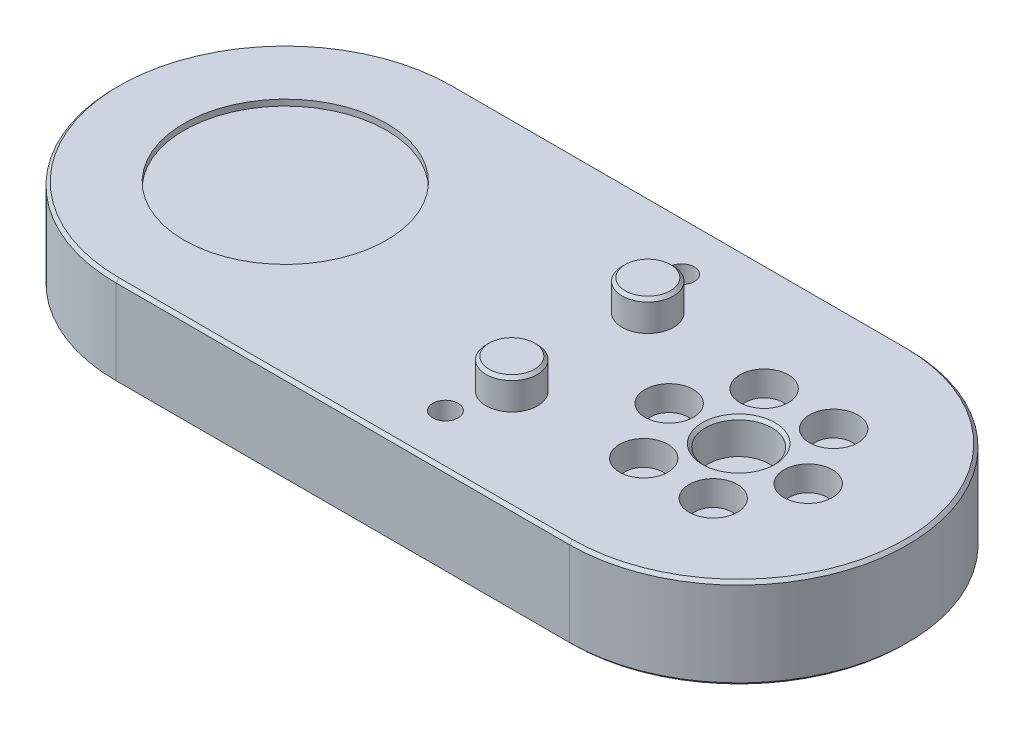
ISO-10303-21;
HEADER;
FILE_DESCRIPTION(('STEP AP214'),'2;1');
FILE_NAME('part.step','',(''),(''),'','','');
FILE_SCHEMA(('AUTOMOTIVE_DESIGN { 1 0 10303 214 1 1 1 1 }'));
ENDSEC;
DATA;
#1=APPLICATION_CONTEXT('core data for automotive mechanical design processes');
#2=APPLICATION_PROTOCOL_DEFINITION('international standard','automotive_design',2000,#1);
#3=PRODUCT_CONTEXT('',#1,'mechanical');
#4=PRODUCT('Part','Part','',(#3));
#5=PRODUCT_RELATED_PRODUCT_CATEGORY('part','',(#4));
#6=PRODUCT_DEFINITION_FORMATION('','',#4);
#7=PRODUCT_DEFINITION_CONTEXT('part definition',#1,'design');
#8=PRODUCT_DEFINITION('design','',#6,#7);
#9=PRODUCT_DEFINITION_SHAPE('','',#8);
#10=(LENGTH_UNIT() NAMED_UNIT(*) SI_UNIT(.MILLI.,.METRE.));
#11=(NAMED_UNIT(*) PLANE_ANGLE_UNIT() SI_UNIT($,.RADIAN.));
#12=(NAMED_UNIT(*) SI_UNIT($,.STERADIAN.) SOLID_ANGLE_UNIT());
#13=UNCERTAINTY_MEASURE_WITH_UNIT(LENGTH_MEASURE(1.E-05),#10,'distance_accuracy_value','');
#14=(GEOMETRIC_REPRESENTATION_CONTEXT(3) GLOBAL_UNCERTAINTY_ASSIGNED_CONTEXT((#13)) GLOBAL_UNIT_ASSIGNED_CONTEXT((#10,
#11,#12)) REPRESENTATION_CONTEXT('',''));
#15=CARTESIAN_POINT('',(0.,0.,0.));
#16=DIRECTION('',(0.,0.,1.));
#17=DIRECTION('',(1.,0.,0.));
#18=AXIS2_PLACEMENT_3D('',#15,#16,#17);
#19=CARTESIAN_POINT('',(0.,15.,0.));
#20=DIRECTION('',(0.,1.,0.));
#21=DIRECTION('',(1.,0.,0.));
#22=AXIS2_PLACEMENT_3D('',#19,#20,#21);
#23=PLANE('',#22);
#24=CARTESIAN_POINT('',(75.,15.,0.));
#25=DIRECTION('',(0.,-1.,0.));
#26=DIRECTION('',(0.,0.,-1.));
#27=AXIS2_PLACEMENT_3D('',#24,#25,#26);
#28=CIRCLE('',#27,6.);
#29=CARTESIAN_POINT('',(75.,15.,-6.));
#30=VERTEX_POINT('',#29);
#31=EDGE_CURVE('E11',#30,#30,#28,.T.);
#32=ORIENTED_EDGE('',*,*,#31,.T.);
#33=EDGE_LOOP('',(#32));
#34=FACE_BOUND('',#33,.T.);
#35=CARTESIAN_POINT('',(0.,15.,0.));
#36=DIRECTION('',(0.,-1.,0.));
#37=DIRECTION('',(0.,0.,-1.));
#38=AXIS2_PLACEMENT_3D('',#35,#36,#37);
#39=CIRCLE('',#38,16.75);
#40=CARTESIAN_POINT('',(0.,15.,-16.75));
#41=VERTEX_POINT('',#40);
#42=EDGE_CURVE('E27',#41,#41,#39,.T.);
#43=ORIENTED_EDGE('',*,*,#42,.T.);
#44=EDGE_LOOP('',(#43));
#45=FACE_BOUND('',#44,.T.);
#46=CARTESIAN_POINT('',(80.75,15.,-9.95929214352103));
#47=DIRECTION('',(0.,-1.,0.));
#48=DIRECTION('',(0.,0.,-1.));
#49=AXIS2_PLACEMENT_3D('',#46,#47,#48);
#50=CIRCLE('',#49,4.);
#51=CARTESIAN_POINT('',(80.75,15.,-13.959292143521));
#52=VERTEX_POINT('',#51);
#53=EDGE_CURVE('E653',#52,#52,#50,.T.);
#54=ORIENTED_EDGE('',*,*,#53,.T.);
#55=EDGE_LOOP('',(#54));
#56=FACE_BOUND('',#55,.T.);
#57=CARTESIAN_POINT('',(86.5,15.,0.));
#58=DIRECTION('',(0.,-1.,0.));
#59=DIRECTION('',(0.,0.,-1.));
#60=AXIS2_PLACEMENT_3D('',#57,#58,#59);
#61=CIRCLE('',#60,4.);
#62=CARTESIAN_POINT('',(86.5,15.,-4.));
#63=VERTEX_POINT('',#62);
#64=EDGE_CURVE('E657',#63,#63,#61,.T.);
#65=ORIENTED_EDGE('',*,*,#64,.T.);
#66=EDGE_LOOP('',(#65));
#67=FACE_BOUND('',#66,.T.);
#68=CARTESIAN_POINT('',(80.75,15.,9.95929214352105));
#69=DIRECTION('',(0.,-1.,0.));
#70=DIRECTION('',(0.,0.,-1.));
#71=AXIS2_PLACEMENT_3D('',#68,#69,#70);
#72=CIRCLE('',#71,4.);
#73=CARTESIAN_POINT('',(80.75,15.,5.95929214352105));
#74=VERTEX_POINT('',#73);
#75=EDGE_CURVE('E673',#74,#74,#72,.T.);
#76=ORIENTED_EDGE('',*,*,#75,.T.);
#77=EDGE_LOOP('',(#76));
#78=FACE_BOUND('',#77,.T.);
#79=CARTESIAN_POINT('',(69.25,15.,9.95929214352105));
#80=DIRECTION('',(0.,-1.,0.));
#81=DIRECTION('',(0.,0.,-1.));
#82=AXIS2_PLACEMENT_3D('',#79,#80,#81);
#83=CIRCLE('',#82,4.);
#84=CARTESIAN_POINT('',(69.25,15.,5.95929214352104));
#85=VERTEX_POINT('',#84);
#86=EDGE_CURVE('E669',#85,#85,#83,.T.);
#87=ORIENTED_EDGE('',*,*,#86,.T.);
#88=EDGE_LOOP('',(#87));
#89=FACE_BOUND('',#88,.T.);
#90=CARTESIAN_POINT('',(69.25,15.,-9.95929214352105));
#91=DIRECTION('',(0.,-1.,0.));
#92=DIRECTION('',(0.,0.,-1.));
#93=AXIS2_PLACEMENT_3D('',#90,#91,#92);
#94=CIRCLE('',#93,4.);
#95=CARTESIAN_POINT('',(69.25,15.,-13.9592921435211));
#96=VERTEX_POINT('',#95);
#97=EDGE_CURVE('E595',#96,#96,#94,.T.);
#98=ORIENTED_EDGE('',*,*,#97,.T.);
#99=EDGE_LOOP('',(#98));
#100=FACE_BOUND('',#99,.T.);
#101=CARTESIAN_POINT('',(63.5,15.,0.));
#102=DIRECTION('',(0.,-1.,0.));
#103=DIRECTION('',(0.,0.,-1.));
#104=AXIS2_PLACEMENT_3D('',#101,#102,#103);
#105=CIRCLE('',#104,4.);
#106=CARTESIAN_POINT('',(63.5,15.,-4.));
#107=VERTEX_POINT('',#106);
#108=EDGE_CURVE('E591',#107,#107,#105,.T.);
#109=ORIENTED_EDGE('',*,*,#108,.T.);
#110=EDGE_LOOP('',(#109));
#111=FACE_BOUND('',#110,.T.);
#112=CARTESIAN_POINT('',(46.025242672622,15.,19.5365564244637));
#113=DIRECTION('',(0.,-1.,0.));
#114=DIRECTION('',(0.,0.,-1.));
#115=AXIS2_PLACEMENT_3D('',#112,#113,#114);
#116=CIRCLE('',#115,2.1);
#117=CARTESIAN_POINT('',(46.025242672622,15.,17.4365564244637));
#118=VERTEX_POINT('',#117);
#119=EDGE_CURVE('E272',#118,#118,#116,.T.);
#120=ORIENTED_EDGE('',*,*,#119,.T.);
#121=EDGE_LOOP('',(#120));
#122=FACE_BOUND('',#121,.T.);
#123=CARTESIAN_POINT('',(46.025242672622,15.,-19.5365564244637));
#124=DIRECTION('',(0.,-1.,0.));
#125=DIRECTION('',(0.,0.,-1.));
#126=AXIS2_PLACEMENT_3D('',#123,#124,#125);
#127=CIRCLE('',#126,2.1);
#128=CARTESIAN_POINT('',(46.025242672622,15.,-21.6365564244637));
#129=VERTEX_POINT('',#128);
#130=EDGE_CURVE('E281',#129,#129,#127,.T.);
#131=ORIENTED_EDGE('',*,*,#130,.T.);
#132=EDGE_LOOP('',(#131));
#133=FACE_BOUND('',#132,.T.);
#134=CARTESIAN_POINT('',(48.7185032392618,15.,11.2475527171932));
#135=DIRECTION('',(0.,-1.,0.));
#136=DIRECTION('',(0.,0.,-1.));
#137=AXIS2_PLACEMENT_3D('',#134,#135,#136);
#138=CIRCLE('',#137,4.25);
#139=CARTESIAN_POINT('',(48.7185032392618,15.,6.99755271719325));
#140=VERTEX_POINT('',#139);
#141=EDGE_CURVE('E511',#140,#140,#138,.T.);
#142=ORIENTED_EDGE('',*,*,#141,.T.);
#143=EDGE_LOOP('',(#142));
#144=FACE_BOUND('',#143,.T.);
#145=CARTESIAN_POINT('',(48.7185032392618,15.,-11.2475527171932));
#146=DIRECTION('',(0.,-1.,0.));
#147=DIRECTION('',(0.,0.,-1.));
#148=AXIS2_PLACEMENT_3D('',#145,#146,#147);
#149=CIRCLE('',#148,4.25);
#150=CARTESIAN_POINT('',(48.7185032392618,15.,-15.4975527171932));
#151=VERTEX_POINT('',#150);
#152=EDGE_CURVE('E318',#151,#151,#149,.T.);
#153=ORIENTED_EDGE('',*,*,#152,.T.);
#154=EDGE_LOOP('',(#153));
#155=FACE_BOUND('',#154,.T.);
#156=DIRECTION('',(-1.,0.,0.));
#157=VECTOR('',#156,1.);
#158=CARTESIAN_POINT('',(150.,15.,27.5));
#159=LINE('',#158,#157);
#160=CARTESIAN_POINT('',(75.,15.,27.5));
#161=VERTEX_POINT('',#160);
#162=CARTESIAN_POINT('',(0.,15.,27.5));
#163=VERTEX_POINT('',#162);
#164=EDGE_CURVE('E20',#161,#163,#159,.T.);
#165=ORIENTED_EDGE('',*,*,#164,.F.);
#166=CARTESIAN_POINT('',(75.,15.,0.));
#167=DIRECTION('',(0.,-1.,0.));
#168=DIRECTION('',(0.,0.,-1.));
#169=AXIS2_PLACEMENT_3D('',#166,#167,#168);
#170=CIRCLE('',#169,27.5);
#171=CARTESIAN_POINT('',(75.,15.,-27.5));
#172=VERTEX_POINT('',#171);
#173=EDGE_CURVE('E562',#172,#161,#170,.T.);
#174=ORIENTED_EDGE('',*,*,#173,.F.);
#175=DIRECTION('',(-1.,0.,0.));
#176=VECTOR('',#175,1.);
#177=CARTESIAN_POINT('',(150.,15.,-27.5));
#178=LINE('',#177,#176);
#179=CARTESIAN_POINT('',(0.,15.,-27.5));
#180=VERTEX_POINT('',#179);
#181=EDGE_CURVE('E482',#172,#180,#178,.T.);
#182=ORIENTED_EDGE('',*,*,#181,.T.);
#183=CARTESIAN_POINT('',(0.,15.,0.));
#184=DIRECTION('',(0.,1.,0.));
#185=DIRECTION('',(0.,0.,1.));
#186=AXIS2_PLACEMENT_3D('',#183,#184,#185);
#187=CIRCLE('',#186,27.5);
#188=EDGE_CURVE('E481',#180,#163,#187,.T.);
#189=ORIENTED_EDGE('',*,*,#188,.T.);
#190=EDGE_LOOP('',(#165,#174,#182,#189));
#191=FACE_BOUND('',#190,.T.);
#192=ADVANCED_FACE('F16',(#34,#45,#56,#67,#78,#89,#100,#111,#122,#133,#144,#155,#191),#23,.T.);
#193=CARTESIAN_POINT('',(0.,0.,0.));
#194=DIRECTION('',(0.,1.,0.));
#195=DIRECTION('',(1.,0.,0.));
#196=AXIS2_PLACEMENT_3D('',#193,#194,#195);
#197=PLANE('',#196);
#198=CARTESIAN_POINT('',(6.45,0.,-11.0851251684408));
#199=DIRECTION('',(0.,-1.,0.));
#200=DIRECTION('',(0.,0.,-1.));
#201=AXIS2_PLACEMENT_3D('',#198,#199,#200);
#202=CIRCLE('',#201,4.);
#203=CARTESIAN_POINT('',(6.45,0.,-15.0851251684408));
#204=VERTEX_POINT('',#203);
#205=EDGE_CURVE('E646',#204,#204,#202,.T.);
#206=ORIENTED_EDGE('',*,*,#205,.F.);
#207=EDGE_LOOP('',(#206));
#208=FACE_BOUND('',#207,.T.);
#209=CARTESIAN_POINT('',(12.85,0.,0.));
#210=DIRECTION('',(0.,-1.,0.));
#211=DIRECTION('',(0.,0.,-1.));
#212=AXIS2_PLACEMENT_3D('',#209,#210,#211);
#213=CIRCLE('',#212,4.);
#214=CARTESIAN_POINT('',(12.85,0.,-4.));
#215=VERTEX_POINT('',#214);
#216=EDGE_CURVE('E590',#215,#215,#213,.T.);
#217=ORIENTED_EDGE('',*,*,#216,.F.);
#218=EDGE_LOOP('',(#217));
#219=FACE_BOUND('',#218,.T.);
#220=CARTESIAN_POINT('',(6.45,0.,11.0851251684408));
#221=DIRECTION('',(0.,-1.,0.));
#222=DIRECTION('',(0.,0.,-1.));
#223=AXIS2_PLACEMENT_3D('',#220,#221,#222);
#224=CIRCLE('',#223,4.);
#225=CARTESIAN_POINT('',(6.45,0.,7.08512516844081));
#226=VERTEX_POINT('',#225);
#227=EDGE_CURVE('E691',#226,#226,#224,.T.);
#228=ORIENTED_EDGE('',*,*,#227,.F.);
#229=EDGE_LOOP('',(#228));
#230=FACE_BOUND('',#229,.T.);
#231=CARTESIAN_POINT('',(-6.35,0.,11.0851251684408));
#232=DIRECTION('',(0.,-1.,0.));
#233=DIRECTION('',(0.,0.,-1.));
#234=AXIS2_PLACEMENT_3D('',#231,#232,#233);
#235=CIRCLE('',#234,4.);
#236=CARTESIAN_POINT('',(-6.35,0.,7.08512516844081));
#237=VERTEX_POINT('',#236);
#238=EDGE_CURVE('E568',#237,#237,#235,.T.);
#239=ORIENTED_EDGE('',*,*,#238,.F.);
#240=EDGE_LOOP('',(#239));
#241=FACE_BOUND('',#240,.T.);
#242=CARTESIAN_POINT('',(-6.35,0.,-11.0851251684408));
#243=DIRECTION('',(0.,-1.,0.));
#244=DIRECTION('',(0.,0.,-1.));
#245=AXIS2_PLACEMENT_3D('',#242,#243,#244);
#246=CIRCLE('',#245,4.);
#247=CARTESIAN_POINT('',(-6.35,0.,-15.0851251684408));
#248=VERTEX_POINT('',#247);
#249=EDGE_CURVE('E794',#248,#248,#246,.T.);
#250=ORIENTED_EDGE('',*,*,#249,.F.);
#251=EDGE_LOOP('',(#250));
#252=FACE_BOUND('',#251,.T.);
#253=CARTESIAN_POINT('',(-12.75,0.,0.));
#254=DIRECTION('',(0.,-1.,0.));
#255=DIRECTION('',(0.,0.,-1.));
#256=AXIS2_PLACEMENT_3D('',#253,#254,#255);
#257=CIRCLE('',#256,4.);
#258=CARTESIAN_POINT('',(-12.75,0.,-4.));
#259=VERTEX_POINT('',#258);
#260=EDGE_CURVE('E714',#259,#259,#257,.T.);
#261=ORIENTED_EDGE('',*,*,#260,.F.);
#262=EDGE_LOOP('',(#261));
#263=FACE_BOUND('',#262,.T.);
#264=CARTESIAN_POINT('',(75.,0.,0.));
#265=DIRECTION('',(0.,-1.,0.));
#266=DIRECTION('',(0.,0.,-1.));
#267=AXIS2_PLACEMENT_3D('',#264,#265,#266);
#268=CIRCLE('',#267,15.5);
#269=CARTESIAN_POINT('',(75.,0.,-15.5));
#270=VERTEX_POINT('',#269);
#271=EDGE_CURVE('E703',#270,#270,#268,.T.);
#272=ORIENTED_EDGE('',*,*,#271,.F.);
#273=EDGE_LOOP('',(#272));
#274=FACE_BOUND('',#273,.T.);
#275=CARTESIAN_POINT('',(48.7185032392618,0.,11.2475527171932));
#276=DIRECTION('',(0.,-1.,0.));
#277=DIRECTION('',(0.,0.,-1.));
#278=AXIS2_PLACEMENT_3D('',#275,#276,#277);
#279=CIRCLE('',#278,2.1);
#280=CARTESIAN_POINT('',(48.7185032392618,0.,9.14755271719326));
#281=VERTEX_POINT('',#280);
#282=EDGE_CURVE('E608',#281,#281,#279,.T.);
#283=ORIENTED_EDGE('',*,*,#282,.F.);
#284=EDGE_LOOP('',(#283));
#285=FACE_BOUND('',#284,.T.);
#286=CARTESIAN_POINT('',(48.7185032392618,0.,-11.2475527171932));
#287=DIRECTION('',(0.,-1.,0.));
#288=DIRECTION('',(0.,0.,-1.));
#289=AXIS2_PLACEMENT_3D('',#286,#287,#288);
#290=CIRCLE('',#289,2.1);
#291=CARTESIAN_POINT('',(48.7185032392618,0.,-13.3475527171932));
#292=VERTEX_POINT('',#291);
#293=EDGE_CURVE('E614',#292,#292,#290,.T.);
#294=ORIENTED_EDGE('',*,*,#293,.F.);
#295=EDGE_LOOP('',(#294));
#296=FACE_BOUND('',#295,.T.);
#297=CARTESIAN_POINT('',(46.025242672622,0.,19.5365564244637));
#298=DIRECTION('',(0.,-1.,0.));
#299=DIRECTION('',(0.,0.,-1.));
#300=AXIS2_PLACEMENT_3D('',#297,#298,#299);
#301=CIRCLE('',#300,2.1);
#302=CARTESIAN_POINT('',(46.025242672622,0.,17.4365564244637));
#303=VERTEX_POINT('',#302);
#304=EDGE_CURVE('E545',#303,#303,#301,.T.);
#305=ORIENTED_EDGE('',*,*,#304,.F.);
#306=EDGE_LOOP('',(#305));
#307=FACE_BOUND('',#306,.T.);
#308=CARTESIAN_POINT('',(46.025242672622,0.,-19.5365564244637));
#309=DIRECTION('',(0.,-1.,0.));
#310=DIRECTION('',(0.,0.,-1.));
#311=AXIS2_PLACEMENT_3D('',#308,#309,#310);
#312=CIRCLE('',#311,2.1);
#313=CARTESIAN_POINT('',(46.025242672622,0.,-21.6365564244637));
#314=VERTEX_POINT('',#313);
#315=EDGE_CURVE('E549',#314,#314,#312,.T.);
#316=ORIENTED_EDGE('',*,*,#315,.F.);
#317=EDGE_LOOP('',(#316));
#318=FACE_BOUND('',#317,.T.);
#319=CARTESIAN_POINT('',(0.,0.,0.));
#320=DIRECTION('',(0.,1.,0.));
#321=DIRECTION('',(0.,0.,1.));
#322=AXIS2_PLACEMENT_3D('',#319,#320,#321);
#323=CIRCLE('',#322,27.5);
#324=CARTESIAN_POINT('',(0.,0.,-27.5));
#325=VERTEX_POINT('',#324);
#326=CARTESIAN_POINT('',(0.,0.,27.5));
#327=VERTEX_POINT('',#326);
#328=EDGE_CURVE('E465',#325,#327,#323,.T.);
#329=ORIENTED_EDGE('',*,*,#328,.F.);
#330=DIRECTION('',(-1.,0.,0.));
#331=VECTOR('',#330,1.);
#332=CARTESIAN_POINT('',(150.,0.,-27.5));
#333=LINE('',#332,#331);
#334=CARTESIAN_POINT('',(75.,0.,-27.5));
#335=VERTEX_POINT('',#334);
#336=EDGE_CURVE('E764',#335,#325,#333,.T.);
#337=ORIENTED_EDGE('',*,*,#336,.F.);
#338=CARTESIAN_POINT('',(75.,0.,0.));
#339=DIRECTION('',(0.,-1.,0.));
#340=DIRECTION('',(0.,0.,-1.));
#341=AXIS2_PLACEMENT_3D('',#338,#339,#340);
#342=CIRCLE('',#341,27.5);
#343=CARTESIAN_POINT('',(75.,0.,27.5));
#344=VERTEX_POINT('',#343);
#345=EDGE_CURVE('E483',#335,#344,#342,.T.);
#346=ORIENTED_EDGE('',*,*,#345,.T.);
#347=DIRECTION('',(-1.,0.,0.));
#348=VECTOR('',#347,1.);
#349=CARTESIAN_POINT('',(150.,0.,27.5));
#350=LINE('',#349,#348);
#351=EDGE_CURVE('E492',#344,#327,#350,.T.);
#352=ORIENTED_EDGE('',*,*,#351,.T.);
#353=EDGE_LOOP('',(#329,#337,#346,#352));
#354=FACE_BOUND('',#353,.T.);
#355=ADVANCED_FACE('F855',(#208,#219,#230,#241,#252,#263,#274,#285,#296,#307,#318,#354),#197,.F.);
#356=CARTESIAN_POINT('',(75.,15.,-28.));
#357=DIRECTION('',(0.,0.,1.));
#358=DIRECTION('',(1.,0.,0.));
#359=AXIS2_PLACEMENT_3D('',#356,#357,#358);
#360=PLANE('',#359);
#361=DIRECTION('',(0.,-1.,0.));
#362=VECTOR('',#361,1.);
#363=CARTESIAN_POINT('',(0.,15.,-28.));
#364=LINE('',#363,#362);
#365=CARTESIAN_POINT('',(0.,14.5,-28.));
#366=VERTEX_POINT('',#365);
#367=CARTESIAN_POINT('',(0.,0.5,-28.));
#368=VERTEX_POINT('',#367);
#369=EDGE_CURVE('E456',#366,#368,#364,.T.);
#370=ORIENTED_EDGE('',*,*,#369,.F.);
#371=DIRECTION('',(-1.,0.,0.));
#372=VECTOR('',#371,1.);
#373=CARTESIAN_POINT('',(150.,14.5,-28.));
#374=LINE('',#373,#372);
#375=CARTESIAN_POINT('',(75.,14.5,-28.));
#376=VERTEX_POINT('',#375);
#377=EDGE_CURVE('E522',#376,#366,#374,.T.);
#378=ORIENTED_EDGE('',*,*,#377,.F.);
#379=DIRECTION('',(0.,-1.,0.));
#380=VECTOR('',#379,1.);
#381=CARTESIAN_POINT('',(75.,15.,-28.));
#382=LINE('',#381,#380);
#383=CARTESIAN_POINT('',(75.,0.5,-28.));
#384=VERTEX_POINT('',#383);
#385=EDGE_CURVE('E500',#376,#384,#382,.T.);
#386=ORIENTED_EDGE('',*,*,#385,.T.);
#387=DIRECTION('',(-1.,0.,0.));
#388=VECTOR('',#387,1.);
#389=CARTESIAN_POINT('',(150.,0.5,-28.));
#390=LINE('',#389,#388);
#391=EDGE_CURVE('E517',#384,#368,#390,.T.);
#392=ORIENTED_EDGE('',*,*,#391,.T.);
#393=EDGE_LOOP('',(#370,#378,#386,#392));
#394=FACE_BOUND('',#393,.T.);
#395=ADVANCED_FACE('F858',(#394),#360,.F.);
#396=CARTESIAN_POINT('',(0.,15.,0.));
#397=DIRECTION('',(0.,-1.,0.));
#398=DIRECTION('',(0.,0.,-1.));
#399=AXIS2_PLACEMENT_3D('',#396,#397,#398);
#400=CYLINDRICAL_SURFACE('',#399,28.);
#401=ORIENTED_EDGE('',*,*,#369,.T.);
#402=CARTESIAN_POINT('',(0.,0.5,0.));
#403=DIRECTION('',(0.,1.,0.));
#404=DIRECTION('',(0.,0.,1.));
#405=AXIS2_PLACEMENT_3D('',#402,#403,#404);
#406=CIRCLE('',#405,28.);
#407=CARTESIAN_POINT('',(0.,0.5,28.));
#408=VERTEX_POINT('',#407);
#409=EDGE_CURVE('E453',#368,#408,#406,.T.);
#410=ORIENTED_EDGE('',*,*,#409,.T.);
#411=DIRECTION('',(0.,-1.,0.));
#412=VECTOR('',#411,1.);
#413=CARTESIAN_POINT('',(0.,15.,28.));
#414=LINE('',#413,#412);
#415=CARTESIAN_POINT('',(0.,14.5,28.));
#416=VERTEX_POINT('',#415);
#417=EDGE_CURVE('E441',#416,#408,#414,.T.);
#418=ORIENTED_EDGE('',*,*,#417,.F.);
#419=CARTESIAN_POINT('',(0.,14.5,0.));
#420=DIRECTION('',(0.,1.,0.));
#421=DIRECTION('',(0.,0.,1.));
#422=AXIS2_PLACEMENT_3D('',#419,#420,#421);
#423=CIRCLE('',#422,28.);
#424=EDGE_CURVE('E468',#366,#416,#423,.T.);
#425=ORIENTED_EDGE('',*,*,#424,.F.);
#426=EDGE_LOOP('',(#401,#410,#418,#425));
#427=FACE_BOUND('',#426,.T.);
#428=ADVANCED_FACE('F454',(#427),#400,.T.);
#429=CARTESIAN_POINT('',(0.,15.,28.));
#430=DIRECTION('',(0.,0.,-1.));
#431=DIRECTION('',(0.,-1.,0.));
#432=AXIS2_PLACEMENT_3D('',#429,#430,#431);
#433=PLANE('',#432);
#434=DIRECTION('',(0.,-1.,0.));
#435=VECTOR('',#434,1.);
#436=CARTESIAN_POINT('',(75.,15.,28.));
#437=LINE('',#436,#435);
#438=CARTESIAN_POINT('',(75.,14.5,28.));
#439=VERTEX_POINT('',#438);
#440=CARTESIAN_POINT('',(75.,0.5,28.));
#441=VERTEX_POINT('',#440);
#442=EDGE_CURVE('E474',#439,#441,#437,.T.);
#443=ORIENTED_EDGE('',*,*,#442,.F.);
#444=DIRECTION('',(-1.,0.,0.));
#445=VECTOR('',#444,1.);
#446=CARTESIAN_POINT('',(150.,14.5,28.));
#447=LINE('',#446,#445);
#448=EDGE_CURVE('E445',#439,#416,#447,.T.);
#449=ORIENTED_EDGE('',*,*,#448,.T.);
#450=ORIENTED_EDGE('',*,*,#417,.T.);
#451=DIRECTION('',(-1.,0.,0.));
#452=VECTOR('',#451,1.);
#453=CARTESIAN_POINT('',(150.,0.5,28.));
#454=LINE('',#453,#452);
#455=EDGE_CURVE('E426',#441,#408,#454,.T.);
#456=ORIENTED_EDGE('',*,*,#455,.F.);
#457=EDGE_LOOP('',(#443,#449,#450,#456));
#458=FACE_BOUND('',#457,.T.);
#459=ADVANCED_FACE('F443',(#458),#433,.F.);
#460=CARTESIAN_POINT('',(75.,15.,0.));
#461=DIRECTION('',(0.,-1.,0.));
#462=DIRECTION('',(0.,0.,-1.));
#463=AXIS2_PLACEMENT_3D('',#460,#461,#462);
#464=CYLINDRICAL_SURFACE('',#463,28.);
#465=ORIENTED_EDGE('',*,*,#385,.F.);
#466=CARTESIAN_POINT('',(75.,14.5,0.));
#467=DIRECTION('',(0.,-1.,0.));
#468=DIRECTION('',(0.,0.,-1.));
#469=AXIS2_PLACEMENT_3D('',#466,#467,#468);
#470=CIRCLE('',#469,28.);
#471=EDGE_CURVE('E450',#376,#439,#470,.T.);
#472=ORIENTED_EDGE('',*,*,#471,.T.);
#473=ORIENTED_EDGE('',*,*,#442,.T.);
#474=CARTESIAN_POINT('',(75.,0.5,0.));
#475=DIRECTION('',(0.,-1.,0.));
#476=DIRECTION('',(0.,0.,-1.));
#477=AXIS2_PLACEMENT_3D('',#474,#475,#476);
#478=CIRCLE('',#477,28.);
#479=EDGE_CURVE('E627',#384,#441,#478,.T.);
#480=ORIENTED_EDGE('',*,*,#479,.F.);
#481=EDGE_LOOP('',(#465,#472,#473,#480));
#482=FACE_BOUND('',#481,.T.);
#483=ADVANCED_FACE('F1026',(#482),#464,.T.);
#484=CARTESIAN_POINT('',(0.,0.,0.));
#485=DIRECTION('',(0.,1.,0.));
#486=DIRECTION('',(0.,0.,1.));
#487=AXIS2_PLACEMENT_3D('',#484,#485,#486);
#488=CONICAL_SURFACE('',#487,27.5,0.785398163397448);
#489=ORIENTED_EDGE('',*,*,#409,.F.);
#490=DIRECTION('',(0.,0.707106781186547,-0.707106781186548));
#491=VECTOR('',#490,1.);
#492=CARTESIAN_POINT('',(0.,0.,-27.5));
#493=LINE('',#492,#491);
#494=EDGE_CURVE('E437',#325,#368,#493,.T.);
#495=ORIENTED_EDGE('',*,*,#494,.F.);
#496=ORIENTED_EDGE('',*,*,#328,.T.);
#497=DIRECTION('',(0.,0.707106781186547,0.707106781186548));
#498=VECTOR('',#497,1.);
#499=CARTESIAN_POINT('',(0.,0.,27.5));
#500=LINE('',#499,#498);
#501=EDGE_CURVE('E431',#327,#408,#500,.T.);
#502=ORIENTED_EDGE('',*,*,#501,.T.);
#503=EDGE_LOOP('',(#489,#495,#496,#502));
#504=FACE_BOUND('',#503,.T.);
#505=ADVANCED_FACE('F463',(#504),#488,.T.);
#506=CARTESIAN_POINT('',(0.,14.5,0.));
#507=DIRECTION('',(0.,-1.,0.));
#508=DIRECTION('',(0.,0.,-1.));
#509=AXIS2_PLACEMENT_3D('',#506,#507,#508);
#510=CONICAL_SURFACE('',#509,28.,0.785398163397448);
#511=DIRECTION('',(0.,0.707106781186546,0.707106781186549));
#512=VECTOR('',#511,1.);
#513=CARTESIAN_POINT('',(0.,14.5,-28.));
#514=LINE('',#513,#512);
#515=EDGE_CURVE('E518',#366,#180,#514,.T.);
#516=ORIENTED_EDGE('',*,*,#515,.F.);
#517=ORIENTED_EDGE('',*,*,#424,.T.);
#518=DIRECTION('',(0.,0.707106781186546,-0.707106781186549));
#519=VECTOR('',#518,1.);
#520=CARTESIAN_POINT('',(0.,14.5,28.));
#521=LINE('',#520,#519);
#522=EDGE_CURVE('E477',#416,#163,#521,.T.);
#523=ORIENTED_EDGE('',*,*,#522,.T.);
#524=ORIENTED_EDGE('',*,*,#188,.F.);
#525=EDGE_LOOP('',(#516,#517,#523,#524));
#526=FACE_BOUND('',#525,.T.);
#527=ADVANCED_FACE('F1065',(#526),#510,.T.);
#528=CARTESIAN_POINT('',(75.,15.,0.));
#529=DIRECTION('',(0.,-1.,0.));
#530=DIRECTION('',(0.,0.,-1.));
#531=AXIS2_PLACEMENT_3D('',#528,#529,#530);
#532=CONICAL_SURFACE('',#531,27.5,0.785398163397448);
#533=ORIENTED_EDGE('',*,*,#471,.F.);
#534=DIRECTION('',(0.,-0.707106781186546,-0.707106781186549));
#535=VECTOR('',#534,1.);
#536=CARTESIAN_POINT('',(75.,15.,-27.5));
#537=LINE('',#536,#535);
#538=EDGE_CURVE('E559',#172,#376,#537,.T.);
#539=ORIENTED_EDGE('',*,*,#538,.F.);
#540=ORIENTED_EDGE('',*,*,#173,.T.);
#541=DIRECTION('',(0.,-0.707106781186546,0.707106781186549));
#542=VECTOR('',#541,1.);
#543=CARTESIAN_POINT('',(75.,15.,27.5));
#544=LINE('',#543,#542);
#545=EDGE_CURVE('E630',#161,#439,#544,.T.);
#546=ORIENTED_EDGE('',*,*,#545,.T.);
#547=EDGE_LOOP('',(#533,#539,#540,#546));
#548=FACE_BOUND('',#547,.T.);
#549=ADVANCED_FACE('F1061',(#548),#532,.T.);
#550=CARTESIAN_POINT('',(75.,0.5,0.));
#551=DIRECTION('',(0.,1.,0.));
#552=DIRECTION('',(0.,0.,1.));
#553=AXIS2_PLACEMENT_3D('',#550,#551,#552);
#554=CONICAL_SURFACE('',#553,28.,0.785398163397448);
#555=ORIENTED_EDGE('',*,*,#345,.F.);
#556=DIRECTION('',(0.,-0.707106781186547,0.707106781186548));
#557=VECTOR('',#556,1.);
#558=CARTESIAN_POINT('',(75.,0.5,-28.));
#559=LINE('',#558,#557);
#560=EDGE_CURVE('E767',#384,#335,#559,.T.);
#561=ORIENTED_EDGE('',*,*,#560,.F.);
#562=ORIENTED_EDGE('',*,*,#479,.T.);
#563=DIRECTION('',(0.,-0.707106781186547,-0.707106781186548));
#564=VECTOR('',#563,1.);
#565=CARTESIAN_POINT('',(75.,0.5,28.));
#566=LINE('',#565,#564);
#567=EDGE_CURVE('E433',#441,#344,#566,.T.);
#568=ORIENTED_EDGE('',*,*,#567,.T.);
#569=EDGE_LOOP('',(#555,#561,#562,#568));
#570=FACE_BOUND('',#569,.T.);
#571=ADVANCED_FACE('F1064',(#570),#554,.T.);
#572=CARTESIAN_POINT('',(150.,0.5,28.));
#573=DIRECTION('',(0.,0.707106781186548,-0.707106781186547));
#574=DIRECTION('',(-1.,0.,0.));
#575=AXIS2_PLACEMENT_3D('',#572,#573,#574);
#576=PLANE('',#575);
#577=ORIENTED_EDGE('',*,*,#351,.F.);
#578=ORIENTED_EDGE('',*,*,#567,.F.);
#579=ORIENTED_EDGE('',*,*,#455,.T.);
#580=ORIENTED_EDGE('',*,*,#501,.F.);
#581=EDGE_LOOP('',(#577,#578,#579,#580));
#582=FACE_BOUND('',#581,.T.);
#583=ADVANCED_FACE('F429',(#582),#576,.F.);
#584=CARTESIAN_POINT('',(150.,0.,-27.5));
#585=DIRECTION('',(0.,0.707106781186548,0.707106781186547));
#586=DIRECTION('',(1.,0.,0.));
#587=AXIS2_PLACEMENT_3D('',#584,#585,#586);
#588=PLANE('',#587);
#589=ORIENTED_EDGE('',*,*,#494,.T.);
#590=ORIENTED_EDGE('',*,*,#391,.F.);
#591=ORIENTED_EDGE('',*,*,#560,.T.);
#592=ORIENTED_EDGE('',*,*,#336,.T.);
#593=EDGE_LOOP('',(#589,#590,#591,#592));
#594=FACE_BOUND('',#593,.T.);
#595=ADVANCED_FACE('F1108',(#594),#588,.F.);
#596=CARTESIAN_POINT('',(150.,14.5,-28.));
#597=DIRECTION('',(0.,-0.707106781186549,0.707106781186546));
#598=DIRECTION('',(-1.,0.,0.));
#599=AXIS2_PLACEMENT_3D('',#596,#597,#598);
#600=PLANE('',#599);
#601=ORIENTED_EDGE('',*,*,#181,.F.);
#602=ORIENTED_EDGE('',*,*,#538,.T.);
#603=ORIENTED_EDGE('',*,*,#377,.T.);
#604=ORIENTED_EDGE('',*,*,#515,.T.);
#605=EDGE_LOOP('',(#601,#602,#603,#604));
#606=FACE_BOUND('',#605,.T.);
#607=ADVANCED_FACE('F1111',(#606),#600,.F.);
#608=CARTESIAN_POINT('',(150.,15.,27.5));
#609=DIRECTION('',(0.,-0.707106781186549,-0.707106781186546));
#610=DIRECTION('',(0.,0.707106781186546,-0.707106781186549));
#611=AXIS2_PLACEMENT_3D('',#608,#609,#610);
#612=PLANE('',#611);
#613=ORIENTED_EDGE('',*,*,#522,.F.);
#614=ORIENTED_EDGE('',*,*,#448,.F.);
#615=ORIENTED_EDGE('',*,*,#545,.F.);
#616=ORIENTED_EDGE('',*,*,#164,.T.);
#617=EDGE_LOOP('',(#613,#614,#615,#616));
#618=FACE_BOUND('',#617,.T.);
#619=ADVANCED_FACE('F1100',(#618),#612,.F.);
#620=CARTESIAN_POINT('',(48.7185032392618,20.,-11.2475527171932));
#621=DIRECTION('',(0.,-1.,0.));
#622=DIRECTION('',(0.,0.,-1.));
#623=AXIS2_PLACEMENT_3D('',#620,#621,#622);
#624=PLANE('',#623);
#625=CARTESIAN_POINT('',(48.7185032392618,20.,-11.2475527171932));
#626=DIRECTION('',(0.,-1.,0.));
#627=DIRECTION('',(0.,0.,-1.));
#628=AXIS2_PLACEMENT_3D('',#625,#626,#627);
#629=CIRCLE('',#628,3.75);
#630=CARTESIAN_POINT('',(48.7185032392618,20.,-14.9975527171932));
#631=VERTEX_POINT('',#630);
#632=EDGE_CURVE('E640',#631,#631,#629,.T.);
#633=ORIENTED_EDGE('',*,*,#632,.F.);
#634=EDGE_LOOP('',(#633));
#635=FACE_BOUND('',#634,.T.);
#636=ADVANCED_FACE('F1097',(#635),#624,.F.);
#637=CARTESIAN_POINT('',(48.7185032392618,20.,-11.2475527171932));
#638=DIRECTION('',(0.,-1.,0.));
#639=DIRECTION('',(0.,0.,-1.));
#640=AXIS2_PLACEMENT_3D('',#637,#638,#639);
#641=CONICAL_SURFACE('',#640,3.75,0.785398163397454);
#642=CARTESIAN_POINT('',(48.7185032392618,19.5,-11.2475527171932));
#643=DIRECTION('',(0.,-1.,0.));
#644=DIRECTION('',(0.,0.,-1.));
#645=AXIS2_PLACEMENT_3D('',#642,#643,#644);
#646=CIRCLE('',#645,4.25);
#647=CARTESIAN_POINT('',(48.7185032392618,19.5,-15.4975527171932));
#648=VERTEX_POINT('',#647);
#649=EDGE_CURVE('E636',#648,#648,#646,.T.);
#650=ORIENTED_EDGE('',*,*,#649,.F.);
#651=EDGE_LOOP('',(#650));
#652=FACE_BOUND('',#651,.T.);
#653=ORIENTED_EDGE('',*,*,#632,.T.);
#654=EDGE_LOOP('',(#653));
#655=FACE_BOUND('',#654,.T.);
#656=ADVANCED_FACE('F1037',(#652,#655),#641,.T.);
#657=CARTESIAN_POINT('',(48.7185032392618,15.,-11.2475527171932));
#658=DIRECTION('',(0.,-1.,0.));
#659=DIRECTION('',(0.,0.,-1.));
#660=AXIS2_PLACEMENT_3D('',#657,#658,#659);
#661=CYLINDRICAL_SURFACE('',#660,4.25);
#662=ORIENTED_EDGE('',*,*,#152,.F.);
#663=EDGE_LOOP('',(#662));
#664=FACE_BOUND('',#663,.T.);
#665=ORIENTED_EDGE('',*,*,#649,.T.);
#666=EDGE_LOOP('',(#665));
#667=FACE_BOUND('',#666,.T.);
#668=ADVANCED_FACE('F961',(#664,#667),#661,.T.);
#669=CARTESIAN_POINT('',(48.7185032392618,20.,11.2475527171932));
#670=DIRECTION('',(0.,-1.,0.));
#671=DIRECTION('',(0.,0.,-1.));
#672=AXIS2_PLACEMENT_3D('',#669,#670,#671);
#673=PLANE('',#672);
#674=CARTESIAN_POINT('',(48.7185032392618,20.,11.2475527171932));
#675=DIRECTION('',(0.,-1.,0.));
#676=DIRECTION('',(0.,0.,-1.));
#677=AXIS2_PLACEMENT_3D('',#674,#675,#676);
#678=CIRCLE('',#677,3.75);
#679=CARTESIAN_POINT('',(48.7185032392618,20.,7.49755271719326));
#680=VERTEX_POINT('',#679);
#681=EDGE_CURVE('E641',#680,#680,#678,.T.);
#682=ORIENTED_EDGE('',*,*,#681,.F.);
#683=EDGE_LOOP('',(#682));
#684=FACE_BOUND('',#683,.T.);
#685=ADVANCED_FACE('F957',(#684),#673,.F.);
#686=CARTESIAN_POINT('',(48.7185032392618,20.,11.2475527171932));
#687=DIRECTION('',(0.,-1.,0.));
#688=DIRECTION('',(0.,0.,-1.));
#689=AXIS2_PLACEMENT_3D('',#686,#687,#688);
#690=CONICAL_SURFACE('',#689,3.75,0.785398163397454);
#691=CARTESIAN_POINT('',(48.7185032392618,19.5,11.2475527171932));
#692=DIRECTION('',(0.,-1.,0.));
#693=DIRECTION('',(0.,0.,-1.));
#694=AXIS2_PLACEMENT_3D('',#691,#692,#693);
#695=CIRCLE('',#694,4.25);
#696=CARTESIAN_POINT('',(48.7185032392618,19.5,6.99755271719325));
#697=VERTEX_POINT('',#696);
#698=EDGE_CURVE('E572',#697,#697,#695,.T.);
#699=ORIENTED_EDGE('',*,*,#698,.F.);
#700=EDGE_LOOP('',(#699));
#701=FACE_BOUND('',#700,.T.);
#702=ORIENTED_EDGE('',*,*,#681,.T.);
#703=EDGE_LOOP('',(#702));
#704=FACE_BOUND('',#703,.T.);
#705=ADVANCED_FACE('F960',(#701,#704),#690,.T.);
#706=CARTESIAN_POINT('',(48.7185032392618,15.,11.2475527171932));
#707=DIRECTION('',(0.,-1.,0.));
#708=DIRECTION('',(0.,0.,-1.));
#709=AXIS2_PLACEMENT_3D('',#706,#707,#708);
#710=CYLINDRICAL_SURFACE('',#709,4.25);
#711=ORIENTED_EDGE('',*,*,#141,.F.);
#712=EDGE_LOOP('',(#711));
#713=FACE_BOUND('',#712,.T.);
#714=ORIENTED_EDGE('',*,*,#698,.T.);
#715=EDGE_LOOP('',(#714));
#716=FACE_BOUND('',#715,.T.);
#717=ADVANCED_FACE('F971',(#713,#716),#710,.T.);
#718=CARTESIAN_POINT('',(46.025242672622,0.,-19.5365564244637));
#719=DIRECTION('',(0.,-1.,0.));
#720=DIRECTION('',(0.,0.,-1.));
#721=AXIS2_PLACEMENT_3D('',#718,#719,#720);
#722=CYLINDRICAL_SURFACE('',#721,2.1);
#723=ORIENTED_EDGE('',*,*,#315,.T.);
#724=EDGE_LOOP('',(#723));
#725=FACE_BOUND('',#724,.T.);
#726=ORIENTED_EDGE('',*,*,#130,.F.);
#727=EDGE_LOOP('',(#726));
#728=FACE_BOUND('',#727,.T.);
#729=ADVANCED_FACE('F932',(#725,#728),#722,.F.);
#730=CARTESIAN_POINT('',(46.025242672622,0.,19.5365564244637));
#731=DIRECTION('',(0.,-1.,0.));
#732=DIRECTION('',(0.,0.,-1.));
#733=AXIS2_PLACEMENT_3D('',#730,#731,#732);
#734=CYLINDRICAL_SURFACE('',#733,2.1);
#735=ORIENTED_EDGE('',*,*,#304,.T.);
#736=EDGE_LOOP('',(#735));
#737=FACE_BOUND('',#736,.T.);
#738=ORIENTED_EDGE('',*,*,#119,.F.);
#739=EDGE_LOOP('',(#738));
#740=FACE_BOUND('',#739,.T.);
#741=ADVANCED_FACE('F928',(#737,#740),#734,.F.);
#742=CARTESIAN_POINT('',(48.7185032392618,15.,-11.2475527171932));
#743=DIRECTION('',(0.,-1.,0.));
#744=DIRECTION('',(0.,0.,-1.));
#745=AXIS2_PLACEMENT_3D('',#742,#743,#744);
#746=PLANE('',#745);
#747=CARTESIAN_POINT('',(48.7185032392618,15.,-11.2475527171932));
#748=DIRECTION('',(0.,-1.,0.));
#749=DIRECTION('',(0.,0.,-1.));
#750=AXIS2_PLACEMENT_3D('',#747,#748,#749);
#751=CIRCLE('',#750,2.1);
#752=CARTESIAN_POINT('',(48.7185032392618,15.,-13.3475527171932));
#753=VERTEX_POINT('',#752);
#754=EDGE_CURVE('E550',#753,#753,#751,.T.);
#755=ORIENTED_EDGE('',*,*,#754,.T.);
#756=EDGE_LOOP('',(#755));
#757=FACE_BOUND('',#756,.T.);
#758=ADVANCED_FACE('F931',(#757),#746,.T.);
#759=CARTESIAN_POINT('',(48.7185032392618,0.,-11.2475527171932));
#760=DIRECTION('',(0.,-1.,0.));
#761=DIRECTION('',(0.,0.,-1.));
#762=AXIS2_PLACEMENT_3D('',#759,#760,#761);
#763=CYLINDRICAL_SURFACE('',#762,2.1);
#764=ORIENTED_EDGE('',*,*,#293,.T.);
#765=EDGE_LOOP('',(#764));
#766=FACE_BOUND('',#765,.T.);
#767=ORIENTED_EDGE('',*,*,#754,.F.);
#768=EDGE_LOOP('',(#767));
#769=FACE_BOUND('',#768,.T.);
#770=ADVANCED_FACE('F981',(#766,#769),#763,.F.);
#771=CARTESIAN_POINT('',(48.7185032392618,15.,11.2475527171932));
#772=DIRECTION('',(0.,-1.,0.));
#773=DIRECTION('',(0.,0.,-1.));
#774=AXIS2_PLACEMENT_3D('',#771,#772,#773);
#775=PLANE('',#774);
#776=CARTESIAN_POINT('',(48.7185032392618,15.,11.2475527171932));
#777=DIRECTION('',(0.,-1.,0.));
#778=DIRECTION('',(0.,0.,-1.));
#779=AXIS2_PLACEMENT_3D('',#776,#777,#778);
#780=CIRCLE('',#779,2.1);
#781=CARTESIAN_POINT('',(48.7185032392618,15.,9.14755271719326));
#782=VERTEX_POINT('',#781);
#783=EDGE_CURVE('E611',#782,#782,#780,.T.);
#784=ORIENTED_EDGE('',*,*,#783,.T.);
#785=EDGE_LOOP('',(#784));
#786=FACE_BOUND('',#785,.T.);
#787=ADVANCED_FACE('F950',(#786),#775,.T.);
#788=CARTESIAN_POINT('',(48.7185032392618,0.,11.2475527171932));
#789=DIRECTION('',(0.,-1.,0.));
#790=DIRECTION('',(0.,0.,-1.));
#791=AXIS2_PLACEMENT_3D('',#788,#789,#790);
#792=CYLINDRICAL_SURFACE('',#791,2.1);
#793=ORIENTED_EDGE('',*,*,#282,.T.);
#794=EDGE_LOOP('',(#793));
#795=FACE_BOUND('',#794,.T.);
#796=ORIENTED_EDGE('',*,*,#783,.F.);
#797=EDGE_LOOP('',(#796));
#798=FACE_BOUND('',#797,.T.);
#799=ADVANCED_FACE('F946',(#795,#798),#792,.F.);
#800=CARTESIAN_POINT('',(75.,1.,0.));
#801=DIRECTION('',(0.,-1.,0.));
#802=DIRECTION('',(0.,0.,-1.));
#803=AXIS2_PLACEMENT_3D('',#800,#801,#802);
#804=PLANE('',#803);
#805=CARTESIAN_POINT('',(75.,1.,0.));
#806=DIRECTION('',(0.,-1.,0.));
#807=DIRECTION('',(0.,0.,-1.));
#808=AXIS2_PLACEMENT_3D('',#805,#806,#807);
#809=CIRCLE('',#808,15.5);
#810=CARTESIAN_POINT('',(75.,1.,-15.5));
#811=VERTEX_POINT('',#810);
#812=EDGE_CURVE('E612',#811,#811,#809,.T.);
#813=ORIENTED_EDGE('',*,*,#812,.T.);
#814=EDGE_LOOP('',(#813));
#815=FACE_BOUND('',#814,.T.);
#816=ADVANCED_FACE('F949',(#815),#804,.T.);
#817=CARTESIAN_POINT('',(75.,0.,0.));
#818=DIRECTION('',(0.,-1.,0.));
#819=DIRECTION('',(0.,0.,-1.));
#820=AXIS2_PLACEMENT_3D('',#817,#818,#819);
#821=CYLINDRICAL_SURFACE('',#820,15.5);
#822=ORIENTED_EDGE('',*,*,#271,.T.);
#823=EDGE_LOOP('',(#822));
#824=FACE_BOUND('',#823,.T.);
#825=ORIENTED_EDGE('',*,*,#812,.F.);
#826=EDGE_LOOP('',(#825));
#827=FACE_BOUND('',#826,.T.);
#828=ADVANCED_FACE('F1112',(#824,#827),#821,.F.);
#829=CARTESIAN_POINT('',(63.5,7.5,0.));
#830=DIRECTION('',(0.,-1.,0.));
#831=DIRECTION('',(0.,0.,-1.));
#832=AXIS2_PLACEMENT_3D('',#829,#830,#831);
#833=CYLINDRICAL_SURFACE('',#832,4.);
#834=CARTESIAN_POINT('',(63.5,7.5,0.));
#835=DIRECTION('',(0.,-1.,0.));
#836=DIRECTION('',(0.,0.,-1.));
#837=AXIS2_PLACEMENT_3D('',#834,#835,#836);
#838=CIRCLE('',#837,4.);
#839=CARTESIAN_POINT('',(63.5,7.5,-4.));
#840=VERTEX_POINT('',#839);
#841=EDGE_CURVE('E533',#840,#840,#838,.T.);
#842=ORIENTED_EDGE('',*,*,#841,.T.);
#843=EDGE_LOOP('',(#842));
#844=FACE_BOUND('',#843,.T.);
#845=ORIENTED_EDGE('',*,*,#108,.F.);
#846=EDGE_LOOP('',(#845));
#847=FACE_BOUND('',#846,.T.);
#848=ADVANCED_FACE('F1045',(#844,#847),#833,.F.);
#849=CARTESIAN_POINT('',(67.5,7.5,0.));
#850=DIRECTION('',(0.,1.,0.));
#851=DIRECTION('',(1.,0.,0.));
#852=AXIS2_PLACEMENT_3D('',#849,#850,#851);
#853=PLANE('',#852);
#854=CARTESIAN_POINT('',(63.5,7.5,0.));
#855=DIRECTION('',(0.,-1.,0.));
#856=DIRECTION('',(0.,0.,-1.));
#857=AXIS2_PLACEMENT_3D('',#854,#855,#856);
#858=CIRCLE('',#857,3.5);
#859=CARTESIAN_POINT('',(63.5,7.5,-3.5));
#860=VERTEX_POINT('',#859);
#861=EDGE_CURVE('E529',#860,#860,#858,.T.);
#862=ORIENTED_EDGE('',*,*,#861,.T.);
#863=EDGE_LOOP('',(#862));
#864=FACE_BOUND('',#863,.T.);
#865=ORIENTED_EDGE('',*,*,#841,.F.);
#866=EDGE_LOOP('',(#865));
#867=FACE_BOUND('',#866,.T.);
#868=ADVANCED_FACE('F926',(#864,#867),#853,.T.);
#869=CARTESIAN_POINT('',(63.5,7.5,0.));
#870=DIRECTION('',(0.,-1.,0.));
#871=DIRECTION('',(0.,0.,-1.));
#872=AXIS2_PLACEMENT_3D('',#869,#870,#871);
#873=CYLINDRICAL_SURFACE('',#872,3.5);
#874=CARTESIAN_POINT('',(63.5,11.1,0.));
#875=DIRECTION('',(0.,-1.,0.));
#876=DIRECTION('',(0.,0.,-1.));
#877=AXIS2_PLACEMENT_3D('',#874,#875,#876);
#878=CIRCLE('',#877,3.5);
#879=CARTESIAN_POINT('',(63.5,11.1,-3.5));
#880=VERTEX_POINT('',#879);
#881=EDGE_CURVE('E534',#880,#880,#878,.T.);
#882=ORIENTED_EDGE('',*,*,#881,.T.);
#883=EDGE_LOOP('',(#882));
#884=FACE_BOUND('',#883,.T.);
#885=ORIENTED_EDGE('',*,*,#861,.F.);
#886=EDGE_LOOP('',(#885));
#887=FACE_BOUND('',#886,.T.);
#888=ADVANCED_FACE('F922',(#884,#887),#873,.T.);
#889=CARTESIAN_POINT('',(63.5,11.1,0.));
#890=DIRECTION('',(0.,-1.,0.));
#891=DIRECTION('',(0.,0.,-1.));
#892=AXIS2_PLACEMENT_3D('',#889,#890,#891);
#893=CONICAL_SURFACE('',#892,3.5,0.785398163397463);
#894=CARTESIAN_POINT('',(63.5,11.5,0.));
#895=DIRECTION('',(0.,-1.,0.));
#896=DIRECTION('',(0.,0.,-1.));
#897=AXIS2_PLACEMENT_3D('',#894,#895,#896);
#898=CIRCLE('',#897,3.1);
#899=CARTESIAN_POINT('',(63.5,11.5,-3.1));
#900=VERTEX_POINT('',#899);
#901=EDGE_CURVE('E573',#900,#900,#898,.T.);
#902=ORIENTED_EDGE('',*,*,#901,.T.);
#903=EDGE_LOOP('',(#902));
#904=FACE_BOUND('',#903,.T.);
#905=ORIENTED_EDGE('',*,*,#881,.F.);
#906=EDGE_LOOP('',(#905));
#907=FACE_BOUND('',#906,.T.);
#908=ADVANCED_FACE('F925',(#904,#907),#893,.T.);
#909=CARTESIAN_POINT('',(66.6,11.5,0.));
#910=DIRECTION('',(0.,1.,0.));
#911=DIRECTION('',(1.,0.,0.));
#912=AXIS2_PLACEMENT_3D('',#909,#910,#911);
#913=PLANE('',#912);
#914=ORIENTED_EDGE('',*,*,#901,.F.);
#915=EDGE_LOOP('',(#914));
#916=FACE_BOUND('',#915,.T.);
#917=ADVANCED_FACE('F1083',(#916),#913,.T.);
#918=CARTESIAN_POINT('',(69.25,7.5,-9.95929214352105));
#919=DIRECTION('',(0.,-1.,0.));
#920=DIRECTION('',(0.,0.,-1.));
#921=AXIS2_PLACEMENT_3D('',#918,#919,#920);
#922=CYLINDRICAL_SURFACE('',#921,4.);
#923=CARTESIAN_POINT('',(69.25,7.5,-9.95929214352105));
#924=DIRECTION('',(0.,-1.,0.));
#925=DIRECTION('',(0.,0.,-1.));
#926=AXIS2_PLACEMENT_3D('',#923,#924,#925);
#927=CIRCLE('',#926,4.);
#928=CARTESIAN_POINT('',(69.25,7.5,-13.9592921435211));
#929=VERTEX_POINT('',#928);
#930=EDGE_CURVE('E577',#929,#929,#927,.T.);
#931=ORIENTED_EDGE('',*,*,#930,.T.);
#932=EDGE_LOOP('',(#931));
#933=FACE_BOUND('',#932,.T.);
#934=ORIENTED_EDGE('',*,*,#97,.F.);
#935=EDGE_LOOP('',(#934));
#936=FACE_BOUND('',#935,.T.);
#937=ADVANCED_FACE('F1230',(#933,#936),#922,.F.);
#938=CARTESIAN_POINT('',(73.25,7.5,-9.95929214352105));
#939=DIRECTION('',(0.,1.,0.));
#940=DIRECTION('',(1.,0.,0.));
#941=AXIS2_PLACEMENT_3D('',#938,#939,#940);
#942=PLANE('',#941);
#943=CARTESIAN_POINT('',(69.25,7.5,-9.95929214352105));
#944=DIRECTION('',(0.,-1.,0.));
#945=DIRECTION('',(0.,0.,-1.));
#946=AXIS2_PLACEMENT_3D('',#943,#944,#945);
#947=CIRCLE('',#946,3.5);
#948=CARTESIAN_POINT('',(69.25,7.5,-13.4592921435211));
#949=VERTEX_POINT('',#948);
#950=EDGE_CURVE('E555',#949,#949,#947,.T.);
#951=ORIENTED_EDGE('',*,*,#950,.T.);
#952=EDGE_LOOP('',(#951));
#953=FACE_BOUND('',#952,.T.);
#954=ORIENTED_EDGE('',*,*,#930,.F.);
#955=EDGE_LOOP('',(#954));
#956=FACE_BOUND('',#955,.T.);
#957=ADVANCED_FACE('F1071',(#953,#956),#942,.T.);
#958=CARTESIAN_POINT('',(69.25,7.5,-9.95929214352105));
#959=DIRECTION('',(0.,-1.,0.));
#960=DIRECTION('',(0.,0.,-1.));
#961=AXIS2_PLACEMENT_3D('',#958,#959,#960);
#962=CYLINDRICAL_SURFACE('',#961,3.5);
#963=CARTESIAN_POINT('',(69.25,11.1,-9.95929214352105));
#964=DIRECTION('',(0.,-1.,0.));
#965=DIRECTION('',(0.,0.,-1.));
#966=AXIS2_PLACEMENT_3D('',#963,#964,#965);
#967=CIRCLE('',#966,3.5);
#968=CARTESIAN_POINT('',(69.25,11.1,-13.4592921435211));
#969=VERTEX_POINT('',#968);
#970=EDGE_CURVE('E551',#969,#969,#967,.T.);
#971=ORIENTED_EDGE('',*,*,#970,.T.);
#972=EDGE_LOOP('',(#971));
#973=FACE_BOUND('',#972,.T.);
#974=ORIENTED_EDGE('',*,*,#950,.F.);
#975=EDGE_LOOP('',(#974));
#976=FACE_BOUND('',#975,.T.);
#977=ADVANCED_FACE('F1067',(#973,#976),#962,.T.);
#978=CARTESIAN_POINT('',(69.25,11.1,-9.95929214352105));
#979=DIRECTION('',(0.,-1.,0.));
#980=DIRECTION('',(0.,0.,-1.));
#981=AXIS2_PLACEMENT_3D('',#978,#979,#980);
#982=CONICAL_SURFACE('',#981,3.5,0.785398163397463);
#983=CARTESIAN_POINT('',(69.25,11.5,-9.95929214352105));
#984=DIRECTION('',(0.,-1.,0.));
#985=DIRECTION('',(0.,0.,-1.));
#986=AXIS2_PLACEMENT_3D('',#983,#984,#985);
#987=CIRCLE('',#986,3.1);
#988=CARTESIAN_POINT('',(69.25,11.5,-13.059292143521));
#989=VERTEX_POINT('',#988);
#990=EDGE_CURVE('E556',#989,#989,#987,.T.);
#991=ORIENTED_EDGE('',*,*,#990,.T.);
#992=EDGE_LOOP('',(#991));
#993=FACE_BOUND('',#992,.T.);
#994=ORIENTED_EDGE('',*,*,#970,.F.);
#995=EDGE_LOOP('',(#994));
#996=FACE_BOUND('',#995,.T.);
#997=ADVANCED_FACE('F1070',(#993,#996),#982,.T.);
#998=CARTESIAN_POINT('',(72.35,11.5,-9.95929214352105));
#999=DIRECTION('',(0.,1.,0.));
#1000=DIRECTION('',(1.,0.,0.));
#1001=AXIS2_PLACEMENT_3D('',#998,#999,#1000);
#1002=PLANE('',#1001);
#1003=ORIENTED_EDGE('',*,*,#990,.F.);
#1004=EDGE_LOOP('',(#1003));
#1005=FACE_BOUND('',#1004,.T.);
#1006=ADVANCED_FACE('F1152',(#1005),#1002,.T.);
#1007=CARTESIAN_POINT('',(69.25,7.5,9.95929214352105));
#1008=DIRECTION('',(0.,-1.,0.));
#1009=DIRECTION('',(0.,0.,-1.));
#1010=AXIS2_PLACEMENT_3D('',#1007,#1008,#1009);
#1011=CYLINDRICAL_SURFACE('',#1010,4.);
#1012=CARTESIAN_POINT('',(69.25,7.5,9.95929214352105));
#1013=DIRECTION('',(0.,-1.,0.));
#1014=DIRECTION('',(0.,0.,-1.));
#1015=AXIS2_PLACEMENT_3D('',#1012,#1013,#1014);
#1016=CIRCLE('',#1015,4.);
#1017=CARTESIAN_POINT('',(69.25,7.5,5.95929214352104));
#1018=VERTEX_POINT('',#1017);
#1019=EDGE_CURVE('E730',#1018,#1018,#1016,.T.);
#1020=ORIENTED_EDGE('',*,*,#1019,.T.);
#1021=EDGE_LOOP('',(#1020));
#1022=FACE_BOUND('',#1021,.T.);
#1023=ORIENTED_EDGE('',*,*,#86,.F.);
#1024=EDGE_LOOP('',(#1023));
#1025=FACE_BOUND('',#1024,.T.);
#1026=ADVANCED_FACE('F1155',(#1022,#1025),#1011,.F.);
#1027=CARTESIAN_POINT('',(73.25,7.5,9.95929214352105));
#1028=DIRECTION('',(0.,1.,0.));
#1029=DIRECTION('',(1.,0.,0.));
#1030=AXIS2_PLACEMENT_3D('',#1027,#1028,#1029);
#1031=PLANE('',#1030);
#1032=CARTESIAN_POINT('',(69.25,7.5,9.95929214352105));
#1033=DIRECTION('',(0.,-1.,0.));
#1034=DIRECTION('',(0.,0.,-1.));
#1035=AXIS2_PLACEMENT_3D('',#1032,#1033,#1034);
#1036=CIRCLE('',#1035,3.5);
#1037=CARTESIAN_POINT('',(69.25,7.5,6.45929214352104));
#1038=VERTEX_POINT('',#1037);
#1039=EDGE_CURVE('E606',#1038,#1038,#1036,.T.);
#1040=ORIENTED_EDGE('',*,*,#1039,.T.);
#1041=EDGE_LOOP('',(#1040));
#1042=FACE_BOUND('',#1041,.T.);
#1043=ORIENTED_EDGE('',*,*,#1019,.F.);
#1044=EDGE_LOOP('',(#1043));
#1045=FACE_BOUND('',#1044,.T.);
#1046=ADVANCED_FACE('F1275',(#1042,#1045),#1031,.T.);
#1047=CARTESIAN_POINT('',(69.25,7.5,9.95929214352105));
#1048=DIRECTION('',(0.,-1.,0.));
#1049=DIRECTION('',(0.,0.,-1.));
#1050=AXIS2_PLACEMENT_3D('',#1047,#1048,#1049);
#1051=CYLINDRICAL_SURFACE('',#1050,3.5);
#1052=CARTESIAN_POINT('',(69.25,11.1,9.95929214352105));
#1053=DIRECTION('',(0.,-1.,0.));
#1054=DIRECTION('',(0.,0.,-1.));
#1055=AXIS2_PLACEMENT_3D('',#1052,#1053,#1054);
#1056=CIRCLE('',#1055,3.5);
#1057=CARTESIAN_POINT('',(69.25,11.1,6.45929214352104));
#1058=VERTEX_POINT('',#1057);
#1059=EDGE_CURVE('E602',#1058,#1058,#1056,.T.);
#1060=ORIENTED_EDGE('',*,*,#1059,.T.);
#1061=EDGE_LOOP('',(#1060));
#1062=FACE_BOUND('',#1061,.T.);
#1063=ORIENTED_EDGE('',*,*,#1039,.F.);
#1064=EDGE_LOOP('',(#1063));
#1065=FACE_BOUND('',#1064,.T.);
#1066=ADVANCED_FACE('F1144',(#1062,#1065),#1051,.T.);
#1067=CARTESIAN_POINT('',(69.25,11.1,9.95929214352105));
#1068=DIRECTION('',(0.,-1.,0.));
#1069=DIRECTION('',(0.,0.,-1.));
#1070=AXIS2_PLACEMENT_3D('',#1067,#1068,#1069);
#1071=CONICAL_SURFACE('',#1070,3.5,0.785398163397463);
#1072=CARTESIAN_POINT('',(69.25,11.5,9.95929214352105));
#1073=DIRECTION('',(0.,-1.,0.));
#1074=DIRECTION('',(0.,0.,-1.));
#1075=AXIS2_PLACEMENT_3D('',#1072,#1073,#1074);
#1076=CIRCLE('',#1075,3.1);
#1077=CARTESIAN_POINT('',(69.25,11.5,6.85929214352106));
#1078=VERTEX_POINT('',#1077);
#1079=EDGE_CURVE('E607',#1078,#1078,#1076,.T.);
#1080=ORIENTED_EDGE('',*,*,#1079,.T.);
#1081=EDGE_LOOP('',(#1080));
#1082=FACE_BOUND('',#1081,.T.);
#1083=ORIENTED_EDGE('',*,*,#1059,.F.);
#1084=EDGE_LOOP('',(#1083));
#1085=FACE_BOUND('',#1084,.T.);
#1086=ADVANCED_FACE('F1141',(#1082,#1085),#1071,.T.);
#1087=CARTESIAN_POINT('',(72.35,11.5,9.95929214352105));
#1088=DIRECTION('',(0.,1.,0.));
#1089=DIRECTION('',(1.,0.,0.));
#1090=AXIS2_PLACEMENT_3D('',#1087,#1088,#1089);
#1091=PLANE('',#1090);
#1092=ORIENTED_EDGE('',*,*,#1079,.F.);
#1093=EDGE_LOOP('',(#1092));
#1094=FACE_BOUND('',#1093,.T.);
#1095=ADVANCED_FACE('F938',(#1094),#1091,.T.);
#1096=CARTESIAN_POINT('',(80.75,7.5,9.95929214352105));
#1097=DIRECTION('',(0.,-1.,0.));
#1098=DIRECTION('',(0.,0.,-1.));
#1099=AXIS2_PLACEMENT_3D('',#1096,#1097,#1098);
#1100=CYLINDRICAL_SURFACE('',#1099,4.);
#1101=CARTESIAN_POINT('',(80.75,7.5,9.95929214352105));
#1102=DIRECTION('',(0.,-1.,0.));
#1103=DIRECTION('',(0.,0.,-1.));
#1104=AXIS2_PLACEMENT_3D('',#1101,#1102,#1103);
#1105=CIRCLE('',#1104,4.);
#1106=CARTESIAN_POINT('',(80.75,7.5,5.95929214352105));
#1107=VERTEX_POINT('',#1106);
#1108=EDGE_CURVE('E668',#1107,#1107,#1105,.T.);
#1109=ORIENTED_EDGE('',*,*,#1108,.T.);
#1110=EDGE_LOOP('',(#1109));
#1111=FACE_BOUND('',#1110,.T.);
#1112=ORIENTED_EDGE('',*,*,#75,.F.);
#1113=EDGE_LOOP('',(#1112));
#1114=FACE_BOUND('',#1113,.T.);
#1115=ADVANCED_FACE('F934',(#1111,#1114),#1100,.F.);
#1116=CARTESIAN_POINT('',(84.75,7.5,9.95929214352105));
#1117=DIRECTION('',(0.,1.,0.));
#1118=DIRECTION('',(1.,0.,0.));
#1119=AXIS2_PLACEMENT_3D('',#1116,#1117,#1118);
#1120=PLANE('',#1119);
#1121=CARTESIAN_POINT('',(80.75,7.5,9.95929214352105));
#1122=DIRECTION('',(0.,-1.,0.));
#1123=DIRECTION('',(0.,0.,-1.));
#1124=AXIS2_PLACEMENT_3D('',#1121,#1122,#1123);
#1125=CIRCLE('',#1124,3.5);
#1126=CARTESIAN_POINT('',(80.75,7.5,6.45929214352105));
#1127=VERTEX_POINT('',#1126);
#1128=EDGE_CURVE('E702',#1127,#1127,#1125,.T.);
#1129=ORIENTED_EDGE('',*,*,#1128,.T.);
#1130=EDGE_LOOP('',(#1129));
#1131=FACE_BOUND('',#1130,.T.);
#1132=ORIENTED_EDGE('',*,*,#1108,.F.);
#1133=EDGE_LOOP('',(#1132));
#1134=FACE_BOUND('',#1133,.T.);
#1135=ADVANCED_FACE('F937',(#1131,#1134),#1120,.T.);
#1136=CARTESIAN_POINT('',(80.75,7.5,9.95929214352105));
#1137=DIRECTION('',(0.,-1.,0.));
#1138=DIRECTION('',(0.,0.,-1.));
#1139=AXIS2_PLACEMENT_3D('',#1136,#1137,#1138);
#1140=CYLINDRICAL_SURFACE('',#1139,3.5);
#1141=CARTESIAN_POINT('',(80.75,11.1,9.95929214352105));
#1142=DIRECTION('',(0.,-1.,0.));
#1143=DIRECTION('',(0.,0.,-1.));
#1144=AXIS2_PLACEMENT_3D('',#1141,#1142,#1143);
#1145=CIRCLE('',#1144,3.5);
#1146=CARTESIAN_POINT('',(80.75,11.1,6.45929214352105));
#1147=VERTEX_POINT('',#1146);
#1148=EDGE_CURVE('E635',#1147,#1147,#1145,.T.);
#1149=ORIENTED_EDGE('',*,*,#1148,.T.);
#1150=EDGE_LOOP('',(#1149));
#1151=FACE_BOUND('',#1150,.T.);
#1152=ORIENTED_EDGE('',*,*,#1128,.F.);
#1153=EDGE_LOOP('',(#1152));
#1154=FACE_BOUND('',#1153,.T.);
#1155=ADVANCED_FACE('F985',(#1151,#1154),#1140,.T.);
#1156=CARTESIAN_POINT('',(80.75,11.1,9.95929214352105));
#1157=DIRECTION('',(0.,-1.,0.));
#1158=DIRECTION('',(0.,0.,-1.));
#1159=AXIS2_PLACEMENT_3D('',#1156,#1157,#1158);
#1160=CONICAL_SURFACE('',#1159,3.5,0.785398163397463);
#1161=CARTESIAN_POINT('',(80.75,11.5,9.95929214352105));
#1162=DIRECTION('',(0.,-1.,0.));
#1163=DIRECTION('',(0.,0.,-1.));
#1164=AXIS2_PLACEMENT_3D('',#1161,#1162,#1163);
#1165=CIRCLE('',#1164,3.1);
#1166=CARTESIAN_POINT('',(80.75,11.5,6.85929214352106));
#1167=VERTEX_POINT('',#1166);
#1168=EDGE_CURVE('E631',#1167,#1167,#1165,.T.);
#1169=ORIENTED_EDGE('',*,*,#1168,.T.);
#1170=EDGE_LOOP('',(#1169));
#1171=FACE_BOUND('',#1170,.T.);
#1172=ORIENTED_EDGE('',*,*,#1148,.F.);
#1173=EDGE_LOOP('',(#1172));
#1174=FACE_BOUND('',#1173,.T.);
#1175=ADVANCED_FACE('F1088',(#1171,#1174),#1160,.T.);
#1176=CARTESIAN_POINT('',(83.85,11.5,9.95929214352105));
#1177=DIRECTION('',(0.,1.,0.));
#1178=DIRECTION('',(1.,0.,0.));
#1179=AXIS2_PLACEMENT_3D('',#1176,#1177,#1178);
#1180=PLANE('',#1179);
#1181=ORIENTED_EDGE('',*,*,#1168,.F.);
#1182=EDGE_LOOP('',(#1181));
#1183=FACE_BOUND('',#1182,.T.);
#1184=ADVANCED_FACE('F1085',(#1183),#1180,.T.);
#1185=CARTESIAN_POINT('',(86.5,7.5,0.));
#1186=DIRECTION('',(0.,-1.,0.));
#1187=DIRECTION('',(0.,0.,-1.));
#1188=AXIS2_PLACEMENT_3D('',#1185,#1186,#1187);
#1189=CYLINDRICAL_SURFACE('',#1188,4.);
#1190=CARTESIAN_POINT('',(86.5,7.5,0.));
#1191=DIRECTION('',(0.,-1.,0.));
#1192=DIRECTION('',(0.,0.,-1.));
#1193=AXIS2_PLACEMENT_3D('',#1190,#1191,#1192);
#1194=CIRCLE('',#1193,4.);
#1195=CARTESIAN_POINT('',(86.5,7.5,-4.));
#1196=VERTEX_POINT('',#1195);
#1197=EDGE_CURVE('E504',#1196,#1196,#1194,.T.);
#1198=ORIENTED_EDGE('',*,*,#1197,.T.);
#1199=EDGE_LOOP('',(#1198));
#1200=FACE_BOUND('',#1199,.T.);
#1201=ORIENTED_EDGE('',*,*,#64,.F.);
#1202=EDGE_LOOP('',(#1201));
#1203=FACE_BOUND('',#1202,.T.);
#1204=ADVANCED_FACE('F920',(#1200,#1203),#1189,.F.);
#1205=CARTESIAN_POINT('',(90.5,7.5,0.));
#1206=DIRECTION('',(0.,1.,0.));
#1207=DIRECTION('',(1.,0.,0.));
#1208=AXIS2_PLACEMENT_3D('',#1205,#1206,#1207);
#1209=PLANE('',#1208);
#1210=CARTESIAN_POINT('',(86.5,7.5,0.));
#1211=DIRECTION('',(0.,-1.,0.));
#1212=DIRECTION('',(0.,0.,-1.));
#1213=AXIS2_PLACEMENT_3D('',#1210,#1211,#1212);
#1214=CIRCLE('',#1213,3.5);
#1215=CARTESIAN_POINT('',(86.5,7.5,-3.5));
#1216=VERTEX_POINT('',#1215);
#1217=EDGE_CURVE('E798',#1216,#1216,#1214,.T.);
#1218=ORIENTED_EDGE('',*,*,#1217,.T.);
#1219=EDGE_LOOP('',(#1218));
#1220=FACE_BOUND('',#1219,.T.);
#1221=ORIENTED_EDGE('',*,*,#1197,.F.);
#1222=EDGE_LOOP('',(#1221));
#1223=FACE_BOUND('',#1222,.T.);
#1224=ADVANCED_FACE('F993',(#1220,#1223),#1209,.T.);
#1225=CARTESIAN_POINT('',(86.5,7.5,0.));
#1226=DIRECTION('',(0.,-1.,0.));
#1227=DIRECTION('',(0.,0.,-1.));
#1228=AXIS2_PLACEMENT_3D('',#1225,#1226,#1227);
#1229=CYLINDRICAL_SURFACE('',#1228,3.5);
#1230=CARTESIAN_POINT('',(86.5,11.1,0.));
#1231=DIRECTION('',(0.,-1.,0.));
#1232=DIRECTION('',(0.,0.,-1.));
#1233=AXIS2_PLACEMENT_3D('',#1230,#1231,#1232);
#1234=CIRCLE('',#1233,3.5);
#1235=CARTESIAN_POINT('',(86.5,11.1,-3.5));
#1236=VERTEX_POINT('',#1235);
#1237=EDGE_CURVE('E787',#1236,#1236,#1234,.T.);
#1238=ORIENTED_EDGE('',*,*,#1237,.T.);
#1239=EDGE_LOOP('',(#1238));
#1240=FACE_BOUND('',#1239,.T.);
#1241=ORIENTED_EDGE('',*,*,#1217,.F.);
#1242=EDGE_LOOP('',(#1241));
#1243=FACE_BOUND('',#1242,.T.);
#1244=ADVANCED_FACE('F996',(#1240,#1243),#1229,.T.);
#1245=CARTESIAN_POINT('',(86.5,11.1,0.));
#1246=DIRECTION('',(0.,-1.,0.));
#1247=DIRECTION('',(0.,0.,-1.));
#1248=AXIS2_PLACEMENT_3D('',#1245,#1246,#1247);
#1249=CONICAL_SURFACE('',#1248,3.5,0.785398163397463);
#1250=CARTESIAN_POINT('',(86.5,11.5,0.));
#1251=DIRECTION('',(0.,-1.,0.));
#1252=DIRECTION('',(0.,0.,-1.));
#1253=AXIS2_PLACEMENT_3D('',#1250,#1251,#1252);
#1254=CIRCLE('',#1253,3.1);
#1255=CARTESIAN_POINT('',(86.5,11.5,-3.1));
#1256=VERTEX_POINT('',#1255);
#1257=EDGE_CURVE('E584',#1256,#1256,#1254,.T.);
#1258=ORIENTED_EDGE('',*,*,#1257,.T.);
#1259=EDGE_LOOP('',(#1258));
#1260=FACE_BOUND('',#1259,.T.);
#1261=ORIENTED_EDGE('',*,*,#1237,.F.);
#1262=EDGE_LOOP('',(#1261));
#1263=FACE_BOUND('',#1262,.T.);
#1264=ADVANCED_FACE('F1047',(#1260,#1263),#1249,.T.);
#1265=CARTESIAN_POINT('',(89.6,11.5,0.));
#1266=DIRECTION('',(0.,1.,0.));
#1267=DIRECTION('',(1.,0.,0.));
#1268=AXIS2_PLACEMENT_3D('',#1265,#1266,#1267);
#1269=PLANE('',#1268);
#1270=ORIENTED_EDGE('',*,*,#1257,.F.);
#1271=EDGE_LOOP('',(#1270));
#1272=FACE_BOUND('',#1271,.T.);
#1273=ADVANCED_FACE('F1050',(#1272),#1269,.T.);
#1274=CARTESIAN_POINT('',(80.75,7.5,-9.95929214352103));
#1275=DIRECTION('',(0.,-1.,0.));
#1276=DIRECTION('',(0.,0.,-1.));
#1277=AXIS2_PLACEMENT_3D('',#1274,#1275,#1276);
#1278=CYLINDRICAL_SURFACE('',#1277,4.);
#1279=CARTESIAN_POINT('',(80.75,7.5,-9.95929214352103));
#1280=DIRECTION('',(0.,-1.,0.));
#1281=DIRECTION('',(0.,0.,-1.));
#1282=AXIS2_PLACEMENT_3D('',#1279,#1280,#1281);
#1283=CIRCLE('',#1282,4.);
#1284=CARTESIAN_POINT('',(80.75,7.5,-13.959292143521));
#1285=VERTEX_POINT('',#1284);
#1286=EDGE_CURVE('E543',#1285,#1285,#1283,.T.);
#1287=ORIENTED_EDGE('',*,*,#1286,.T.);
#1288=EDGE_LOOP('',(#1287));
#1289=FACE_BOUND('',#1288,.T.);
#1290=ORIENTED_EDGE('',*,*,#53,.F.);
#1291=EDGE_LOOP('',(#1290));
#1292=FACE_BOUND('',#1291,.T.);
#1293=ADVANCED_FACE('F1012',(#1289,#1292),#1278,.F.);
#1294=CARTESIAN_POINT('',(84.75,7.5,-9.95929214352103));
#1295=DIRECTION('',(0.,1.,0.));
#1296=DIRECTION('',(1.,0.,0.));
#1297=AXIS2_PLACEMENT_3D('',#1294,#1295,#1296);
#1298=PLANE('',#1297);
#1299=CARTESIAN_POINT('',(80.75,7.5,-9.95929214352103));
#1300=DIRECTION('',(0.,-1.,0.));
#1301=DIRECTION('',(0.,0.,-1.));
#1302=AXIS2_PLACEMENT_3D('',#1299,#1300,#1301);
#1303=CIRCLE('',#1302,3.5);
#1304=CARTESIAN_POINT('',(80.75,7.5,-13.459292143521));
#1305=VERTEX_POINT('',#1304);
#1306=EDGE_CURVE('E539',#1305,#1305,#1303,.T.);
#1307=ORIENTED_EDGE('',*,*,#1306,.T.);
#1308=EDGE_LOOP('',(#1307));
#1309=FACE_BOUND('',#1308,.T.);
#1310=ORIENTED_EDGE('',*,*,#1286,.F.);
#1311=EDGE_LOOP('',(#1310));
#1312=FACE_BOUND('',#1311,.T.);
#1313=ADVANCED_FACE('F1008',(#1309,#1312),#1298,.T.);
#1314=CARTESIAN_POINT('',(80.75,7.5,-9.95929214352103));
#1315=DIRECTION('',(0.,-1.,0.));
#1316=DIRECTION('',(0.,0.,-1.));
#1317=AXIS2_PLACEMENT_3D('',#1314,#1315,#1316);
#1318=CYLINDRICAL_SURFACE('',#1317,3.5);
#1319=CARTESIAN_POINT('',(80.75,11.1,-9.95929214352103));
#1320=DIRECTION('',(0.,-1.,0.));
#1321=DIRECTION('',(0.,0.,-1.));
#1322=AXIS2_PLACEMENT_3D('',#1319,#1320,#1321);
#1323=CIRCLE('',#1322,3.5);
#1324=CARTESIAN_POINT('',(80.75,11.1,-13.459292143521));
#1325=VERTEX_POINT('',#1324);
#1326=EDGE_CURVE('E544',#1325,#1325,#1323,.T.);
#1327=ORIENTED_EDGE('',*,*,#1326,.T.);
#1328=EDGE_LOOP('',(#1327));
#1329=FACE_BOUND('',#1328,.T.);
#1330=ORIENTED_EDGE('',*,*,#1306,.F.);
#1331=EDGE_LOOP('',(#1330));
#1332=FACE_BOUND('',#1331,.T.);
#1333=ADVANCED_FACE('F1011',(#1329,#1332),#1318,.T.);
#1334=CARTESIAN_POINT('',(80.75,11.1,-9.95929214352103));
#1335=DIRECTION('',(0.,-1.,0.));
#1336=DIRECTION('',(0.,0.,-1.));
#1337=AXIS2_PLACEMENT_3D('',#1334,#1335,#1336);
#1338=CONICAL_SURFACE('',#1337,3.5,0.785398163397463);
#1339=CARTESIAN_POINT('',(80.75,11.5,-9.95929214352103));
#1340=DIRECTION('',(0.,-1.,0.));
#1341=DIRECTION('',(0.,0.,-1.));
#1342=AXIS2_PLACEMENT_3D('',#1339,#1340,#1341);
#1343=CIRCLE('',#1342,3.1);
#1344=CARTESIAN_POINT('',(80.75,11.5,-13.059292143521));
#1345=VERTEX_POINT('',#1344);
#1346=EDGE_CURVE('E723',#1345,#1345,#1343,.T.);
#1347=ORIENTED_EDGE('',*,*,#1346,.T.);
#1348=EDGE_LOOP('',(#1347));
#1349=FACE_BOUND('',#1348,.T.);
#1350=ORIENTED_EDGE('',*,*,#1326,.F.);
#1351=EDGE_LOOP('',(#1350));
#1352=FACE_BOUND('',#1351,.T.);
#1353=ADVANCED_FACE('F1090',(#1349,#1352),#1338,.T.);
#1354=CARTESIAN_POINT('',(83.85,11.5,-9.95929214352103));
#1355=DIRECTION('',(0.,1.,0.));
#1356=DIRECTION('',(1.,0.,0.));
#1357=AXIS2_PLACEMENT_3D('',#1354,#1355,#1356);
#1358=PLANE('',#1357);
#1359=ORIENTED_EDGE('',*,*,#1346,.F.);
#1360=EDGE_LOOP('',(#1359));
#1361=FACE_BOUND('',#1360,.T.);
#1362=ADVANCED_FACE('F1041',(#1361),#1358,.T.);
#1363=CARTESIAN_POINT('',(0.,14.,0.));
#1364=DIRECTION('',(0.,-1.,0.));
#1365=DIRECTION('',(0.,0.,-1.));
#1366=AXIS2_PLACEMENT_3D('',#1363,#1364,#1365);
#1367=CYLINDRICAL_SURFACE('',#1366,16.75);
#1368=CARTESIAN_POINT('',(0.,14.,0.));
#1369=DIRECTION('',(0.,-1.,0.));
#1370=DIRECTION('',(0.,0.,-1.));
#1371=AXIS2_PLACEMENT_3D('',#1368,#1369,#1370);
#1372=CIRCLE('',#1371,16.75);
#1373=CARTESIAN_POINT('',(0.,14.,-16.75));
#1374=VERTEX_POINT('',#1373);
#1375=EDGE_CURVE('E684',#1374,#1374,#1372,.T.);
#1376=ORIENTED_EDGE('',*,*,#1375,.T.);
#1377=EDGE_LOOP('',(#1376));
#1378=FACE_BOUND('',#1377,.T.);
#1379=ORIENTED_EDGE('',*,*,#42,.F.);
#1380=EDGE_LOOP('',(#1379));
#1381=FACE_BOUND('',#1380,.T.);
#1382=ADVANCED_FACE('F1038',(#1378,#1381),#1367,.F.);
#1383=CARTESIAN_POINT('',(16.75,14.,0.));
#1384=DIRECTION('',(0.,1.,0.));
#1385=DIRECTION('',(1.,0.,0.));
#1386=AXIS2_PLACEMENT_3D('',#1383,#1384,#1385);
#1387=PLANE('',#1386);
#1388=ORIENTED_EDGE('',*,*,#1375,.F.);
#1389=EDGE_LOOP('',(#1388));
#1390=FACE_BOUND('',#1389,.T.);
#1391=ADVANCED_FACE('F1006',(#1390),#1387,.T.);
#1392=CARTESIAN_POINT('',(75.,15.,0.));
#1393=DIRECTION('',(0.,1.,0.));
#1394=DIRECTION('',(0.,0.,1.));
#1395=AXIS2_PLACEMENT_3D('',#1392,#1393,#1394);
#1396=CONICAL_SURFACE('',#1395,6.,0.78539816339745);
#1397=CARTESIAN_POINT('',(75.,14.5,0.));
#1398=DIRECTION('',(0.,-1.,0.));
#1399=DIRECTION('',(0.,0.,-1.));
#1400=AXIS2_PLACEMENT_3D('',#1397,#1398,#1399);
#1401=CIRCLE('',#1400,5.5);
#1402=CARTESIAN_POINT('',(75.,14.5,-5.5));
#1403=VERTEX_POINT('',#1402);
#1404=EDGE_CURVE('E509',#1403,#1403,#1401,.T.);
#1405=ORIENTED_EDGE('',*,*,#1404,.T.);
#1406=EDGE_LOOP('',(#1405));
#1407=FACE_BOUND('',#1406,.T.);
#1408=ORIENTED_EDGE('',*,*,#31,.F.);
#1409=EDGE_LOOP('',(#1408));
#1410=FACE_BOUND('',#1409,.T.);
#1411=ADVANCED_FACE('F1002',(#1407,#1410),#1396,.F.);
#1412=CARTESIAN_POINT('',(75.,9.6,0.));
#1413=DIRECTION('',(0.,-1.,0.));
#1414=DIRECTION('',(0.,0.,-1.));
#1415=AXIS2_PLACEMENT_3D('',#1412,#1413,#1414);
#1416=CYLINDRICAL_SURFACE('',#1415,5.5);
#1417=CARTESIAN_POINT('',(75.,9.1,0.));
#1418=DIRECTION('',(0.,-1.,0.));
#1419=DIRECTION('',(0.,0.,-1.));
#1420=AXIS2_PLACEMENT_3D('',#1417,#1418,#1419);
#1421=CIRCLE('',#1420,5.5);
#1422=CARTESIAN_POINT('',(75.,9.1,-5.5));
#1423=VERTEX_POINT('',#1422);
#1424=EDGE_CURVE('E506',#1423,#1423,#1421,.T.);
#1425=ORIENTED_EDGE('',*,*,#1424,.T.);
#1426=EDGE_LOOP('',(#1425));
#1427=FACE_BOUND('',#1426,.T.);
#1428=ORIENTED_EDGE('',*,*,#1404,.F.);
#1429=EDGE_LOOP('',(#1428));
#1430=FACE_BOUND('',#1429,.T.);
#1431=ADVANCED_FACE('F998',(#1427,#1430),#1416,.F.);
#1432=CARTESIAN_POINT('',(75.,9.1,0.));
#1433=DIRECTION('',(0.,-1.,0.));
#1434=DIRECTION('',(0.,0.,-1.));
#1435=AXIS2_PLACEMENT_3D('',#1432,#1433,#1434);
#1436=CONICAL_SURFACE('',#1435,5.5,0.78539816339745);
#1437=CARTESIAN_POINT('',(75.,9.6,0.));
#1438=DIRECTION('',(0.,-1.,0.));
#1439=DIRECTION('',(0.,0.,-1.));
#1440=AXIS2_PLACEMENT_3D('',#1437,#1438,#1439);
#1441=CIRCLE('',#1440,5.);
#1442=CARTESIAN_POINT('',(75.,9.6,-5.));
#1443=VERTEX_POINT('',#1442);
#1444=EDGE_CURVE('E510',#1443,#1443,#1441,.T.);
#1445=ORIENTED_EDGE('',*,*,#1444,.T.);
#1446=EDGE_LOOP('',(#1445));
#1447=FACE_BOUND('',#1446,.T.);
#1448=ORIENTED_EDGE('',*,*,#1424,.F.);
#1449=EDGE_LOOP('',(#1448));
#1450=FACE_BOUND('',#1449,.T.);
#1451=ADVANCED_FACE('F1001',(#1447,#1450),#1436,.T.);
#1452=CARTESIAN_POINT('',(80.,9.6,0.));
#1453=DIRECTION('',(0.,1.,0.));
#1454=DIRECTION('',(1.,0.,0.));
#1455=AXIS2_PLACEMENT_3D('',#1452,#1453,#1454);
#1456=PLANE('',#1455);
#1457=ORIENTED_EDGE('',*,*,#1444,.F.);
#1458=EDGE_LOOP('',(#1457));
#1459=FACE_BOUND('',#1458,.T.);
#1460=ADVANCED_FACE('F1127',(#1459),#1456,.T.);
#1461=CARTESIAN_POINT('',(-12.75,1.5,0.));
#1462=DIRECTION('',(0.,-1.,0.));
#1463=DIRECTION('',(0.,0.,-1.));
#1464=AXIS2_PLACEMENT_3D('',#1461,#1462,#1463);
#1465=PLANE('',#1464);
#1466=CARTESIAN_POINT('',(-12.75,1.5,0.));
#1467=DIRECTION('',(0.,-1.,0.));
#1468=DIRECTION('',(0.,0.,-1.));
#1469=AXIS2_PLACEMENT_3D('',#1466,#1467,#1468);
#1470=CIRCLE('',#1469,3.1);
#1471=CARTESIAN_POINT('',(-12.75,1.5,-3.1));
#1472=VERTEX_POINT('',#1471);
#1473=EDGE_CURVE('E599',#1472,#1472,#1470,.T.);
#1474=ORIENTED_EDGE('',*,*,#1473,.T.);
#1475=EDGE_LOOP('',(#1474));
#1476=FACE_BOUND('',#1475,.T.);
#1477=ADVANCED_FACE('F1125',(#1476),#1465,.T.);
#1478=CARTESIAN_POINT('',(-12.75,1.5,0.));
#1479=DIRECTION('',(0.,1.,0.));
#1480=DIRECTION('',(0.,0.,1.));
#1481=AXIS2_PLACEMENT_3D('',#1478,#1479,#1480);
#1482=CONICAL_SURFACE('',#1481,3.1,0.785398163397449);
#1483=CARTESIAN_POINT('',(-12.75,1.9,0.));
#1484=DIRECTION('',(0.,-1.,0.));
#1485=DIRECTION('',(0.,0.,-1.));
#1486=AXIS2_PLACEMENT_3D('',#1483,#1484,#1485);
#1487=CIRCLE('',#1486,3.5);
#1488=CARTESIAN_POINT('',(-12.75,1.9,-3.5));
#1489=VERTEX_POINT('',#1488);
#1490=EDGE_CURVE('E651',#1489,#1489,#1487,.T.);
#1491=ORIENTED_EDGE('',*,*,#1490,.T.);
#1492=EDGE_LOOP('',(#1491));
#1493=FACE_BOUND('',#1492,.T.);
#1494=ORIENTED_EDGE('',*,*,#1473,.F.);
#1495=EDGE_LOOP('',(#1494));
#1496=FACE_BOUND('',#1495,.T.);
#1497=ADVANCED_FACE('F944',(#1493,#1496),#1482,.T.);
#1498=CARTESIAN_POINT('',(-12.75,0.,0.));
#1499=DIRECTION('',(0.,-1.,0.));
#1500=DIRECTION('',(0.,0.,-1.));
#1501=AXIS2_PLACEMENT_3D('',#1498,#1499,#1500);
#1502=CYLINDRICAL_SURFACE('',#1501,3.5);
#1503=CARTESIAN_POINT('',(-12.75,7.5,0.));
#1504=DIRECTION('',(0.,-1.,0.));
#1505=DIRECTION('',(0.,0.,-1.));
#1506=AXIS2_PLACEMENT_3D('',#1503,#1504,#1505);
#1507=CIRCLE('',#1506,3.5);
#1508=CARTESIAN_POINT('',(-12.75,7.5,-3.5));
#1509=VERTEX_POINT('',#1508);
#1510=EDGE_CURVE('E647',#1509,#1509,#1507,.T.);
#1511=ORIENTED_EDGE('',*,*,#1510,.T.);
#1512=EDGE_LOOP('',(#1511));
#1513=FACE_BOUND('',#1512,.T.);
#1514=ORIENTED_EDGE('',*,*,#1490,.F.);
#1515=EDGE_LOOP('',(#1514));
#1516=FACE_BOUND('',#1515,.T.);
#1517=ADVANCED_FACE('F940',(#1513,#1516),#1502,.T.);
#1518=CARTESIAN_POINT('',(-9.25,7.5,0.));
#1519=DIRECTION('',(0.,-1.,0.));
#1520=DIRECTION('',(0.,0.,-1.));
#1521=AXIS2_PLACEMENT_3D('',#1518,#1519,#1520);
#1522=PLANE('',#1521);
#1523=CARTESIAN_POINT('',(-12.75,7.5,0.));
#1524=DIRECTION('',(0.,-1.,0.));
#1525=DIRECTION('',(0.,0.,-1.));
#1526=AXIS2_PLACEMENT_3D('',#1523,#1524,#1525);
#1527=CIRCLE('',#1526,4.);
#1528=CARTESIAN_POINT('',(-12.75,7.5,-4.));
#1529=VERTEX_POINT('',#1528);
#1530=EDGE_CURVE('E652',#1529,#1529,#1527,.T.);
#1531=ORIENTED_EDGE('',*,*,#1530,.T.);
#1532=EDGE_LOOP('',(#1531));
#1533=FACE_BOUND('',#1532,.T.);
#1534=ORIENTED_EDGE('',*,*,#1510,.F.);
#1535=EDGE_LOOP('',(#1534));
#1536=FACE_BOUND('',#1535,.T.);
#1537=ADVANCED_FACE('F943',(#1533,#1536),#1522,.T.);
#1538=CARTESIAN_POINT('',(-12.75,0.,0.));
#1539=DIRECTION('',(0.,-1.,0.));
#1540=DIRECTION('',(0.,0.,-1.));
#1541=AXIS2_PLACEMENT_3D('',#1538,#1539,#1540);
#1542=CYLINDRICAL_SURFACE('',#1541,4.);
#1543=ORIENTED_EDGE('',*,*,#260,.T.);
#1544=EDGE_LOOP('',(#1543));
#1545=FACE_BOUND('',#1544,.T.);
#1546=ORIENTED_EDGE('',*,*,#1530,.F.);
#1547=EDGE_LOOP('',(#1546));
#1548=FACE_BOUND('',#1547,.T.);
#1549=ADVANCED_FACE('F1016',(#1545,#1548),#1542,.F.);
#1550=CARTESIAN_POINT('',(-6.35,1.5,-11.0851251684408));
#1551=DIRECTION('',(0.,-1.,0.));
#1552=DIRECTION('',(0.,0.,-1.));
#1553=AXIS2_PLACEMENT_3D('',#1550,#1551,#1552);
#1554=PLANE('',#1553);
#1555=CARTESIAN_POINT('',(-6.35,1.5,-11.0851251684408));
#1556=DIRECTION('',(0.,-1.,0.));
#1557=DIRECTION('',(0.,0.,-1.));
#1558=AXIS2_PLACEMENT_3D('',#1555,#1556,#1557);
#1559=CIRCLE('',#1558,3.1);
#1560=CARTESIAN_POINT('',(-6.35,1.5,-14.1851251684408));
#1561=VERTEX_POINT('',#1560);
#1562=EDGE_CURVE('E710',#1561,#1561,#1559,.T.);
#1563=ORIENTED_EDGE('',*,*,#1562,.T.);
#1564=EDGE_LOOP('',(#1563));
#1565=FACE_BOUND('',#1564,.T.);
#1566=ADVANCED_FACE('F1052',(#1565),#1554,.T.);
#1567=CARTESIAN_POINT('',(-6.35,1.5,-11.0851251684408));
#1568=DIRECTION('',(0.,1.,0.));
#1569=DIRECTION('',(0.,0.,1.));
#1570=AXIS2_PLACEMENT_3D('',#1567,#1568,#1569);
#1571=CONICAL_SURFACE('',#1570,3.1,0.785398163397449);
#1572=CARTESIAN_POINT('',(-6.35,1.9,-11.0851251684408));
#1573=DIRECTION('',(0.,-1.,0.));
#1574=DIRECTION('',(0.,0.,-1.));
#1575=AXIS2_PLACEMENT_3D('',#1572,#1573,#1574);
#1576=CIRCLE('',#1575,3.5);
#1577=CARTESIAN_POINT('',(-6.35,1.9,-14.5851251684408));
#1578=VERTEX_POINT('',#1577);
#1579=EDGE_CURVE('E689',#1578,#1578,#1576,.T.);
#1580=ORIENTED_EDGE('',*,*,#1579,.T.);
#1581=EDGE_LOOP('',(#1580));
#1582=FACE_BOUND('',#1581,.T.);
#1583=ORIENTED_EDGE('',*,*,#1562,.F.);
#1584=EDGE_LOOP('',(#1583));
#1585=FACE_BOUND('',#1584,.T.);
#1586=ADVANCED_FACE('F1055',(#1582,#1585),#1571,.T.);
#1587=CARTESIAN_POINT('',(-6.35,0.,-11.0851251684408));
#1588=DIRECTION('',(0.,-1.,0.));
#1589=DIRECTION('',(0.,0.,-1.));
#1590=AXIS2_PLACEMENT_3D('',#1587,#1588,#1589);
#1591=CYLINDRICAL_SURFACE('',#1590,3.5);
#1592=CARTESIAN_POINT('',(-6.35,7.5,-11.0851251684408));
#1593=DIRECTION('',(0.,-1.,0.));
#1594=DIRECTION('',(0.,0.,-1.));
#1595=AXIS2_PLACEMENT_3D('',#1592,#1593,#1594);
#1596=CIRCLE('',#1595,3.5);
#1597=CARTESIAN_POINT('',(-6.35,7.5,-14.5851251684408));
#1598=VERTEX_POINT('',#1597);
#1599=EDGE_CURVE('E685',#1598,#1598,#1596,.T.);
#1600=ORIENTED_EDGE('',*,*,#1599,.T.);
#1601=EDGE_LOOP('',(#1600));
#1602=FACE_BOUND('',#1601,.T.);
#1603=ORIENTED_EDGE('',*,*,#1579,.F.);
#1604=EDGE_LOOP('',(#1603));
#1605=FACE_BOUND('',#1604,.T.);
#1606=ADVANCED_FACE('F955',(#1602,#1605),#1591,.T.);
#1607=CARTESIAN_POINT('',(-2.85,7.5,-11.0851251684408));
#1608=DIRECTION('',(0.,-1.,0.));
#1609=DIRECTION('',(0.,0.,-1.));
#1610=AXIS2_PLACEMENT_3D('',#1607,#1608,#1609);
#1611=PLANE('',#1610);
#1612=CARTESIAN_POINT('',(-6.35,7.5,-11.0851251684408));
#1613=DIRECTION('',(0.,-1.,0.));
#1614=DIRECTION('',(0.,0.,-1.));
#1615=AXIS2_PLACEMENT_3D('',#1612,#1613,#1614);
#1616=CIRCLE('',#1615,4.);
#1617=CARTESIAN_POINT('',(-6.35,7.5,-15.0851251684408));
#1618=VERTEX_POINT('',#1617);
#1619=EDGE_CURVE('E690',#1618,#1618,#1616,.T.);
#1620=ORIENTED_EDGE('',*,*,#1619,.T.);
#1621=EDGE_LOOP('',(#1620));
#1622=FACE_BOUND('',#1621,.T.);
#1623=ORIENTED_EDGE('',*,*,#1599,.F.);
#1624=EDGE_LOOP('',(#1623));
#1625=FACE_BOUND('',#1624,.T.);
#1626=ADVANCED_FACE('F952',(#1622,#1625),#1611,.T.);
#1627=CARTESIAN_POINT('',(-6.35,0.,-11.0851251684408));
#1628=DIRECTION('',(0.,-1.,0.));
#1629=DIRECTION('',(0.,0.,-1.));
#1630=AXIS2_PLACEMENT_3D('',#1627,#1628,#1629);
#1631=CYLINDRICAL_SURFACE('',#1630,4.);
#1632=ORIENTED_EDGE('',*,*,#249,.T.);
#1633=EDGE_LOOP('',(#1632));
#1634=FACE_BOUND('',#1633,.T.);
#1635=ORIENTED_EDGE('',*,*,#1619,.F.);
#1636=EDGE_LOOP('',(#1635));
#1637=FACE_BOUND('',#1636,.T.);
#1638=ADVANCED_FACE('F905',(#1634,#1637),#1631,.F.);
#1639=CARTESIAN_POINT('',(-6.35,1.5,11.0851251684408));
#1640=DIRECTION('',(0.,-1.,0.));
#1641=DIRECTION('',(0.,0.,-1.));
#1642=AXIS2_PLACEMENT_3D('',#1639,#1640,#1641);
#1643=PLANE('',#1642);
#1644=CARTESIAN_POINT('',(-6.35,1.5,11.0851251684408));
#1645=DIRECTION('',(0.,-1.,0.));
#1646=DIRECTION('',(0.,0.,-1.));
#1647=AXIS2_PLACEMENT_3D('',#1644,#1645,#1646);
#1648=CIRCLE('',#1647,3.1);
#1649=CARTESIAN_POINT('',(-6.35,1.5,7.98512516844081));
#1650=VERTEX_POINT('',#1649);
#1651=EDGE_CURVE('E808',#1650,#1650,#1648,.T.);
#1652=ORIENTED_EDGE('',*,*,#1651,.T.);
#1653=EDGE_LOOP('',(#1652));
#1654=FACE_BOUND('',#1653,.T.);
#1655=ADVANCED_FACE('F889',(#1654),#1643,.T.);
#1656=CARTESIAN_POINT('',(-6.35,1.5,11.0851251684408));
#1657=DIRECTION('',(0.,1.,0.));
#1658=DIRECTION('',(0.,0.,1.));
#1659=AXIS2_PLACEMENT_3D('',#1656,#1657,#1658);
#1660=CONICAL_SURFACE('',#1659,3.1,0.785398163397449);
#1661=CARTESIAN_POINT('',(-6.35,1.9,11.0851251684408));
#1662=DIRECTION('',(0.,-1.,0.));
#1663=DIRECTION('',(0.,0.,-1.));
#1664=AXIS2_PLACEMENT_3D('',#1661,#1662,#1663);
#1665=CIRCLE('',#1664,3.5);
#1666=CARTESIAN_POINT('',(-6.35,1.9,7.58512516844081));
#1667=VERTEX_POINT('',#1666);
#1668=EDGE_CURVE('E780',#1667,#1667,#1665,.T.);
#1669=ORIENTED_EDGE('',*,*,#1668,.T.);
#1670=EDGE_LOOP('',(#1669));
#1671=FACE_BOUND('',#1670,.T.);
#1672=ORIENTED_EDGE('',*,*,#1651,.F.);
#1673=EDGE_LOOP('',(#1672));
#1674=FACE_BOUND('',#1673,.T.);
#1675=ADVANCED_FACE('F891',(#1671,#1674),#1660,.T.);
#1676=CARTESIAN_POINT('',(-6.35,0.,11.0851251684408));
#1677=DIRECTION('',(0.,-1.,0.));
#1678=DIRECTION('',(0.,0.,-1.));
#1679=AXIS2_PLACEMENT_3D('',#1676,#1677,#1678);
#1680=CYLINDRICAL_SURFACE('',#1679,3.5);
#1681=CARTESIAN_POINT('',(-6.35,7.5,11.0851251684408));
#1682=DIRECTION('',(0.,-1.,0.));
#1683=DIRECTION('',(0.,0.,-1.));
#1684=AXIS2_PLACEMENT_3D('',#1681,#1682,#1683);
#1685=CIRCLE('',#1684,3.5);
#1686=CARTESIAN_POINT('',(-6.35,7.5,7.58512516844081));
#1687=VERTEX_POINT('',#1686);
#1688=EDGE_CURVE('E567',#1687,#1687,#1685,.T.);
#1689=ORIENTED_EDGE('',*,*,#1688,.T.);
#1690=EDGE_LOOP('',(#1689));
#1691=FACE_BOUND('',#1690,.T.);
#1692=ORIENTED_EDGE('',*,*,#1668,.F.);
#1693=EDGE_LOOP('',(#1692));
#1694=FACE_BOUND('',#1693,.T.);
#1695=ADVANCED_FACE('F893',(#1691,#1694),#1680,.T.);
#1696=CARTESIAN_POINT('',(-2.85,7.5,11.0851251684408));
#1697=DIRECTION('',(0.,-1.,0.));
#1698=DIRECTION('',(0.,0.,-1.));
#1699=AXIS2_PLACEMENT_3D('',#1696,#1697,#1698);
#1700=PLANE('',#1699);
#1701=CARTESIAN_POINT('',(-6.35,7.5,11.0851251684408));
#1702=DIRECTION('',(0.,-1.,0.));
#1703=DIRECTION('',(0.,0.,-1.));
#1704=AXIS2_PLACEMENT_3D('',#1701,#1702,#1703);
#1705=CIRCLE('',#1704,4.);
#1706=CARTESIAN_POINT('',(-6.35,7.5,7.08512516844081));
#1707=VERTEX_POINT('',#1706);
#1708=EDGE_CURVE('E563',#1707,#1707,#1705,.T.);
#1709=ORIENTED_EDGE('',*,*,#1708,.T.);
#1710=EDGE_LOOP('',(#1709));
#1711=FACE_BOUND('',#1710,.T.);
#1712=ORIENTED_EDGE('',*,*,#1688,.F.);
#1713=EDGE_LOOP('',(#1712));
#1714=FACE_BOUND('',#1713,.T.);
#1715=ADVANCED_FACE('F902',(#1711,#1714),#1700,.T.);
#1716=CARTESIAN_POINT('',(-6.35,0.,11.0851251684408));
#1717=DIRECTION('',(0.,-1.,0.));
#1718=DIRECTION('',(0.,0.,-1.));
#1719=AXIS2_PLACEMENT_3D('',#1716,#1717,#1718);
#1720=CYLINDRICAL_SURFACE('',#1719,4.);
#1721=ORIENTED_EDGE('',*,*,#238,.T.);
#1722=EDGE_LOOP('',(#1721));
#1723=FACE_BOUND('',#1722,.T.);
#1724=ORIENTED_EDGE('',*,*,#1708,.F.);
#1725=EDGE_LOOP('',(#1724));
#1726=FACE_BOUND('',#1725,.T.);
#1727=ADVANCED_FACE('F852',(#1723,#1726),#1720,.F.);
#1728=CARTESIAN_POINT('',(6.45,1.5,11.0851251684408));
#1729=DIRECTION('',(0.,-1.,0.));
#1730=DIRECTION('',(0.,0.,-1.));
#1731=AXIS2_PLACEMENT_3D('',#1728,#1729,#1730);
#1732=PLANE('',#1731);
#1733=CARTESIAN_POINT('',(6.45,1.5,11.0851251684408));
#1734=DIRECTION('',(0.,-1.,0.));
#1735=DIRECTION('',(0.,0.,-1.));
#1736=AXIS2_PLACEMENT_3D('',#1733,#1734,#1735);
#1737=CIRCLE('',#1736,3.1);
#1738=CARTESIAN_POINT('',(6.45,1.5,7.98512516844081));
#1739=VERTEX_POINT('',#1738);
#1740=EDGE_CURVE('E538',#1739,#1739,#1737,.T.);
#1741=ORIENTED_EDGE('',*,*,#1740,.T.);
#1742=EDGE_LOOP('',(#1741));
#1743=FACE_BOUND('',#1742,.T.);
#1744=ADVANCED_FACE('F1116',(#1743),#1732,.T.);
#1745=CARTESIAN_POINT('',(6.45,1.5,11.0851251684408));
#1746=DIRECTION('',(0.,1.,0.));
#1747=DIRECTION('',(0.,0.,1.));
#1748=AXIS2_PLACEMENT_3D('',#1745,#1746,#1747);
#1749=CONICAL_SURFACE('',#1748,3.1,0.785398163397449);
#1750=CARTESIAN_POINT('',(6.45,1.9,11.0851251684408));
#1751=DIRECTION('',(0.,-1.,0.));
#1752=DIRECTION('',(0.,0.,-1.));
#1753=AXIS2_PLACEMENT_3D('',#1750,#1751,#1752);
#1754=CIRCLE('',#1753,3.5);
#1755=CARTESIAN_POINT('',(6.45,1.9,7.58512516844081));
#1756=VERTEX_POINT('',#1755);
#1757=EDGE_CURVE('E527',#1756,#1756,#1754,.T.);
#1758=ORIENTED_EDGE('',*,*,#1757,.T.);
#1759=EDGE_LOOP('',(#1758));
#1760=FACE_BOUND('',#1759,.T.);
#1761=ORIENTED_EDGE('',*,*,#1740,.F.);
#1762=EDGE_LOOP('',(#1761));
#1763=FACE_BOUND('',#1762,.T.);
#1764=ADVANCED_FACE('F1059',(#1760,#1763),#1749,.T.);
#1765=CARTESIAN_POINT('',(6.45,0.,11.0851251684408));
#1766=DIRECTION('',(0.,-1.,0.));
#1767=DIRECTION('',(0.,0.,-1.));
#1768=AXIS2_PLACEMENT_3D('',#1765,#1766,#1767);
#1769=CYLINDRICAL_SURFACE('',#1768,3.5);
#1770=CARTESIAN_POINT('',(6.45,7.5,11.0851251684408));
#1771=DIRECTION('',(0.,-1.,0.));
#1772=DIRECTION('',(0.,0.,-1.));
#1773=AXIS2_PLACEMENT_3D('',#1770,#1771,#1772);
#1774=CIRCLE('',#1773,3.5);
#1775=CARTESIAN_POINT('',(6.45,7.5,7.58512516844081));
#1776=VERTEX_POINT('',#1775);
#1777=EDGE_CURVE('E523',#1776,#1776,#1774,.T.);
#1778=ORIENTED_EDGE('',*,*,#1777,.T.);
#1779=EDGE_LOOP('',(#1778));
#1780=FACE_BOUND('',#1779,.T.);
#1781=ORIENTED_EDGE('',*,*,#1757,.F.);
#1782=EDGE_LOOP('',(#1781));
#1783=FACE_BOUND('',#1782,.T.);
#1784=ADVANCED_FACE('F967',(#1780,#1783),#1769,.T.);
#1785=CARTESIAN_POINT('',(9.95,7.5,11.0851251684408));
#1786=DIRECTION('',(0.,-1.,0.));
#1787=DIRECTION('',(0.,0.,-1.));
#1788=AXIS2_PLACEMENT_3D('',#1785,#1786,#1787);
#1789=PLANE('',#1788);
#1790=CARTESIAN_POINT('',(6.45,7.5,11.0851251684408));
#1791=DIRECTION('',(0.,-1.,0.));
#1792=DIRECTION('',(0.,0.,-1.));
#1793=AXIS2_PLACEMENT_3D('',#1790,#1791,#1792);
#1794=CIRCLE('',#1793,4.);
#1795=CARTESIAN_POINT('',(6.45,7.5,7.08512516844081));
#1796=VERTEX_POINT('',#1795);
#1797=EDGE_CURVE('E528',#1796,#1796,#1794,.T.);
#1798=ORIENTED_EDGE('',*,*,#1797,.T.);
#1799=EDGE_LOOP('',(#1798));
#1800=FACE_BOUND('',#1799,.T.);
#1801=ORIENTED_EDGE('',*,*,#1777,.F.);
#1802=EDGE_LOOP('',(#1801));
#1803=FACE_BOUND('',#1802,.T.);
#1804=ADVANCED_FACE('F963',(#1800,#1803),#1789,.T.);
#1805=CARTESIAN_POINT('',(6.45,0.,11.0851251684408));
#1806=DIRECTION('',(0.,-1.,0.));
#1807=DIRECTION('',(0.,0.,-1.));
#1808=AXIS2_PLACEMENT_3D('',#1805,#1806,#1807);
#1809=CYLINDRICAL_SURFACE('',#1808,4.);
#1810=ORIENTED_EDGE('',*,*,#227,.T.);
#1811=EDGE_LOOP('',(#1810));
#1812=FACE_BOUND('',#1811,.T.);
#1813=ORIENTED_EDGE('',*,*,#1797,.F.);
#1814=EDGE_LOOP('',(#1813));
#1815=FACE_BOUND('',#1814,.T.);
#1816=ADVANCED_FACE('F966',(#1812,#1815),#1809,.F.);
#1817=CARTESIAN_POINT('',(12.85,1.5,0.));
#1818=DIRECTION('',(0.,-1.,0.));
#1819=DIRECTION('',(0.,0.,-1.));
#1820=AXIS2_PLACEMENT_3D('',#1817,#1818,#1819);
#1821=PLANE('',#1820);
#1822=CARTESIAN_POINT('',(12.85,1.5,0.));
#1823=DIRECTION('',(0.,-1.,0.));
#1824=DIRECTION('',(0.,0.,-1.));
#1825=AXIS2_PLACEMENT_3D('',#1822,#1823,#1824);
#1826=CIRCLE('',#1825,3.1);
#1827=CARTESIAN_POINT('',(12.85,1.5,-3.1));
#1828=VERTEX_POINT('',#1827);
#1829=EDGE_CURVE('E695',#1828,#1828,#1826,.T.);
#1830=ORIENTED_EDGE('',*,*,#1829,.T.);
#1831=EDGE_LOOP('',(#1830));
#1832=FACE_BOUND('',#1831,.T.);
#1833=ADVANCED_FACE('F991',(#1832),#1821,.T.);
#1834=CARTESIAN_POINT('',(12.85,1.5,0.));
#1835=DIRECTION('',(0.,1.,0.));
#1836=DIRECTION('',(0.,0.,1.));
#1837=AXIS2_PLACEMENT_3D('',#1834,#1835,#1836);
#1838=CONICAL_SURFACE('',#1837,3.1,0.785398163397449);
#1839=CARTESIAN_POINT('',(12.85,1.9,0.));
#1840=DIRECTION('',(0.,-1.,0.));
#1841=DIRECTION('',(0.,0.,-1.));
#1842=AXIS2_PLACEMENT_3D('',#1839,#1840,#1841);
#1843=CIRCLE('',#1842,3.5);
#1844=CARTESIAN_POINT('',(12.85,1.9,-3.5));
#1845=VERTEX_POINT('',#1844);
#1846=EDGE_CURVE('E677',#1845,#1845,#1843,.T.);
#1847=ORIENTED_EDGE('',*,*,#1846,.T.);
#1848=EDGE_LOOP('',(#1847));
#1849=FACE_BOUND('',#1848,.T.);
#1850=ORIENTED_EDGE('',*,*,#1829,.F.);
#1851=EDGE_LOOP('',(#1850));
#1852=FACE_BOUND('',#1851,.T.);
#1853=ADVANCED_FACE('F987',(#1849,#1852),#1838,.T.);
#1854=CARTESIAN_POINT('',(12.85,0.,0.));
#1855=DIRECTION('',(0.,-1.,0.));
#1856=DIRECTION('',(0.,0.,-1.));
#1857=AXIS2_PLACEMENT_3D('',#1854,#1855,#1856);
#1858=CYLINDRICAL_SURFACE('',#1857,3.5);
#1859=CARTESIAN_POINT('',(12.85,7.5,0.));
#1860=DIRECTION('',(0.,-1.,0.));
#1861=DIRECTION('',(0.,0.,-1.));
#1862=AXIS2_PLACEMENT_3D('',#1859,#1860,#1861);
#1863=CIRCLE('',#1862,3.5);
#1864=CARTESIAN_POINT('',(12.85,7.5,-3.5));
#1865=VERTEX_POINT('',#1864);
#1866=EDGE_CURVE('E589',#1865,#1865,#1863,.T.);
#1867=ORIENTED_EDGE('',*,*,#1866,.T.);
#1868=EDGE_LOOP('',(#1867));
#1869=FACE_BOUND('',#1868,.T.);
#1870=ORIENTED_EDGE('',*,*,#1846,.F.);
#1871=EDGE_LOOP('',(#1870));
#1872=FACE_BOUND('',#1871,.T.);
#1873=ADVANCED_FACE('F990',(#1869,#1872),#1858,.T.);
#1874=CARTESIAN_POINT('',(16.35,7.5,0.));
#1875=DIRECTION('',(0.,-1.,0.));
#1876=DIRECTION('',(0.,0.,-1.));
#1877=AXIS2_PLACEMENT_3D('',#1874,#1875,#1876);
#1878=PLANE('',#1877);
#1879=CARTESIAN_POINT('',(12.85,7.5,0.));
#1880=DIRECTION('',(0.,-1.,0.));
#1881=DIRECTION('',(0.,0.,-1.));
#1882=AXIS2_PLACEMENT_3D('',#1879,#1880,#1881);
#1883=CIRCLE('',#1882,4.);
#1884=CARTESIAN_POINT('',(12.85,7.5,-4.));
#1885=VERTEX_POINT('',#1884);
#1886=EDGE_CURVE('E585',#1885,#1885,#1883,.T.);
#1887=ORIENTED_EDGE('',*,*,#1886,.T.);
#1888=EDGE_LOOP('',(#1887));
#1889=FACE_BOUND('',#1888,.T.);
#1890=ORIENTED_EDGE('',*,*,#1866,.F.);
#1891=EDGE_LOOP('',(#1890));
#1892=FACE_BOUND('',#1891,.T.);
#1893=ADVANCED_FACE('F1021',(#1889,#1892),#1878,.T.);
#1894=CARTESIAN_POINT('',(12.85,0.,0.));
#1895=DIRECTION('',(0.,-1.,0.));
#1896=DIRECTION('',(0.,0.,-1.));
#1897=AXIS2_PLACEMENT_3D('',#1894,#1895,#1896);
#1898=CYLINDRICAL_SURFACE('',#1897,4.);
#1899=ORIENTED_EDGE('',*,*,#216,.T.);
#1900=EDGE_LOOP('',(#1899));
#1901=FACE_BOUND('',#1900,.T.);
#1902=ORIENTED_EDGE('',*,*,#1886,.F.);
#1903=EDGE_LOOP('',(#1902));
#1904=FACE_BOUND('',#1903,.T.);
#1905=ADVANCED_FACE('F1018',(#1901,#1904),#1898,.F.);
#1906=CARTESIAN_POINT('',(6.45,1.5,-11.0851251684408));
#1907=DIRECTION('',(0.,-1.,0.));
#1908=DIRECTION('',(0.,0.,-1.));
#1909=AXIS2_PLACEMENT_3D('',#1906,#1907,#1908);
#1910=PLANE('',#1909);
#1911=CARTESIAN_POINT('',(6.45,1.5,-11.0851251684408));
#1912=DIRECTION('',(0.,-1.,0.));
#1913=DIRECTION('',(0.,0.,-1.));
#1914=AXIS2_PLACEMENT_3D('',#1911,#1912,#1913);
#1915=CIRCLE('',#1914,3.1);
#1916=CARTESIAN_POINT('',(6.45,1.5,-14.1851251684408));
#1917=VERTEX_POINT('',#1916);
#1918=EDGE_CURVE('E625',#1917,#1917,#1915,.T.);
#1919=ORIENTED_EDGE('',*,*,#1918,.T.);
#1920=EDGE_LOOP('',(#1919));
#1921=FACE_BOUND('',#1920,.T.);
#1922=ADVANCED_FACE('F1020',(#1921),#1910,.T.);
#1923=CARTESIAN_POINT('',(6.45,1.5,-11.0851251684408));
#1924=DIRECTION('',(0.,1.,0.));
#1925=DIRECTION('',(0.,0.,1.));
#1926=AXIS2_PLACEMENT_3D('',#1923,#1924,#1925);
#1927=CONICAL_SURFACE('',#1926,3.1,0.785398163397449);
#1928=CARTESIAN_POINT('',(6.45,1.9,-11.0851251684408));
#1929=DIRECTION('',(0.,-1.,0.));
#1930=DIRECTION('',(0.,0.,-1.));
#1931=AXIS2_PLACEMENT_3D('',#1928,#1929,#1930);
#1932=CIRCLE('',#1931,3.5);
#1933=CARTESIAN_POINT('',(6.45,1.9,-14.5851251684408));
#1934=VERTEX_POINT('',#1933);
#1935=EDGE_CURVE('E621',#1934,#1934,#1932,.T.);
#1936=ORIENTED_EDGE('',*,*,#1935,.T.);
#1937=EDGE_LOOP('',(#1936));
#1938=FACE_BOUND('',#1937,.T.);
#1939=ORIENTED_EDGE('',*,*,#1918,.F.);
#1940=EDGE_LOOP('',(#1939));
#1941=FACE_BOUND('',#1940,.T.);
#1942=ADVANCED_FACE('F977',(#1938,#1941),#1927,.T.);
#1943=CARTESIAN_POINT('',(6.45,0.,-11.0851251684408));
#1944=DIRECTION('',(0.,-1.,0.));
#1945=DIRECTION('',(0.,0.,-1.));
#1946=AXIS2_PLACEMENT_3D('',#1943,#1944,#1945);
#1947=CYLINDRICAL_SURFACE('',#1946,3.5);
#1948=CARTESIAN_POINT('',(6.45,7.5,-11.0851251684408));
#1949=DIRECTION('',(0.,-1.,0.));
#1950=DIRECTION('',(0.,0.,-1.));
#1951=AXIS2_PLACEMENT_3D('',#1948,#1949,#1950);
#1952=CIRCLE('',#1951,3.5);
#1953=CARTESIAN_POINT('',(6.45,7.5,-14.5851251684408));
#1954=VERTEX_POINT('',#1953);
#1955=EDGE_CURVE('E626',#1954,#1954,#1952,.T.);
#1956=ORIENTED_EDGE('',*,*,#1955,.T.);
#1957=EDGE_LOOP('',(#1956));
#1958=FACE_BOUND('',#1957,.T.);
#1959=ORIENTED_EDGE('',*,*,#1935,.F.);
#1960=EDGE_LOOP('',(#1959));
#1961=FACE_BOUND('',#1960,.T.);
#1962=ADVANCED_FACE('F973',(#1958,#1961),#1947,.T.);
#1963=CARTESIAN_POINT('',(9.95,7.5,-11.0851251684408));
#1964=DIRECTION('',(0.,-1.,0.));
#1965=DIRECTION('',(0.,0.,-1.));
#1966=AXIS2_PLACEMENT_3D('',#1963,#1964,#1965);
#1967=PLANE('',#1966);
#1968=CARTESIAN_POINT('',(6.45,7.5,-11.0851251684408));
#1969=DIRECTION('',(0.,-1.,0.));
#1970=DIRECTION('',(0.,0.,-1.));
#1971=AXIS2_PLACEMENT_3D('',#1968,#1969,#1970);
#1972=CIRCLE('',#1971,4.);
#1973=CARTESIAN_POINT('',(6.45,7.5,-15.0851251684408));
#1974=VERTEX_POINT('',#1973);
#1975=EDGE_CURVE('E642',#1974,#1974,#1972,.T.);
#1976=ORIENTED_EDGE('',*,*,#1975,.T.);
#1977=EDGE_LOOP('',(#1976));
#1978=FACE_BOUND('',#1977,.T.);
#1979=ORIENTED_EDGE('',*,*,#1955,.F.);
#1980=EDGE_LOOP('',(#1979));
#1981=FACE_BOUND('',#1980,.T.);
#1982=ADVANCED_FACE('F976',(#1978,#1981),#1967,.T.);
#1983=CARTESIAN_POINT('',(6.45,0.,-11.0851251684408));
#1984=DIRECTION('',(0.,-1.,0.));
#1985=DIRECTION('',(0.,0.,-1.));
#1986=AXIS2_PLACEMENT_3D('',#1983,#1984,#1985);
#1987=CYLINDRICAL_SURFACE('',#1986,4.);
#1988=ORIENTED_EDGE('',*,*,#205,.T.);
#1989=EDGE_LOOP('',(#1988));
#1990=FACE_BOUND('',#1989,.T.);
#1991=ORIENTED_EDGE('',*,*,#1975,.F.);
#1992=EDGE_LOOP('',(#1991));
#1993=FACE_BOUND('',#1992,.T.);
#1994=ADVANCED_FACE('F18',(#1990,#1993),#1987,.F.);
#1995=CLOSED_SHELL('',(#192,#355,#395,#428,#459,#483,#505,#527,#549,#571,#583,#595,#607,#619,
#636,#656,#668,#685,#705,#717,#729,#741,#758,#770,#787,#799,#816,#828,#848,#868,#888,#908,#917,
#937,#957,#977,#997,#1006,#1026,#1046,#1066,#1086,#1095,#1115,#1135,#1155,#1175,#1184,#1204,
#1224,#1244,#1264,#1273,#1293,#1313,#1333,#1353,#1362,#1382,#1391,#1411,#1431,#1451,#1460,#1477,
#1497,#1517,#1537,#1549,#1566,#1586,#1606,#1626,#1638,#1655,#1675,#1695,#1715,#1727,#1744,#1764,
#1784,#1804,#1816,#1833,#1853,#1873,#1893,#1905,#1922,#1942,#1962,#1982,#1994));
#1996=MANIFOLD_SOLID_BREP('B1',#1995);
#1997=ADVANCED_BREP_SHAPE_REPRESENTATION('',(#18,#1996),#14);
#1998=SHAPE_DEFINITION_REPRESENTATION(#9,#1997);
ENDSEC;
END-ISO-10303-21;
